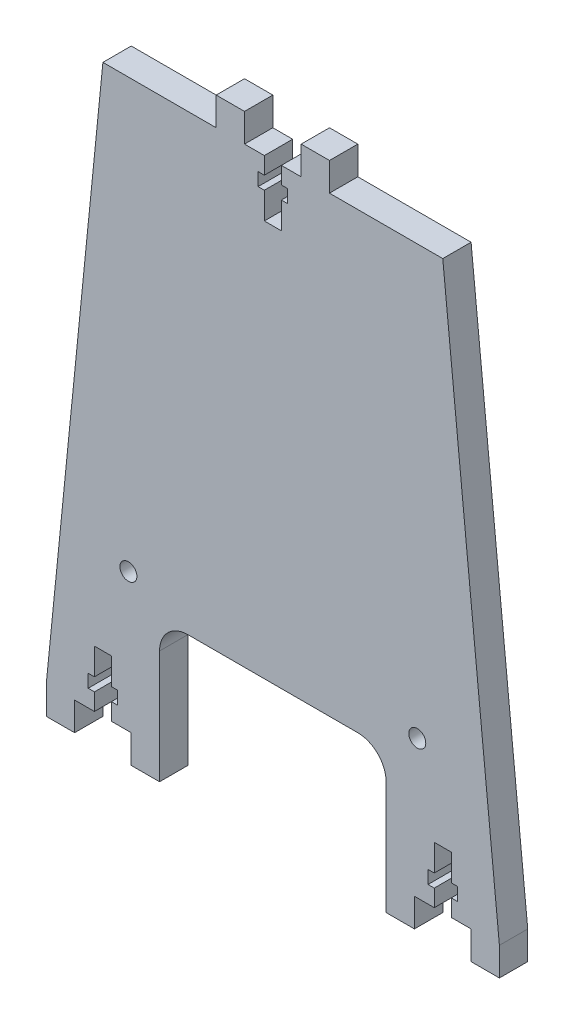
ISO-10303-21;
HEADER;
FILE_DESCRIPTION(('STEP AP214'),'2;1');
FILE_NAME('part.step','',(''),(''),'','','');
FILE_SCHEMA(('AUTOMOTIVE_DESIGN { 1 0 10303 214 1 1 1 1 }'));
ENDSEC;
DATA;
#1=APPLICATION_CONTEXT('core data for automotive mechanical design processes');
#2=APPLICATION_PROTOCOL_DEFINITION('international standard','automotive_design',2000,#1);
#3=PRODUCT_CONTEXT('',#1,'mechanical');
#4=PRODUCT('Part','Part','',(#3));
#5=PRODUCT_RELATED_PRODUCT_CATEGORY('part','',(#4));
#6=PRODUCT_DEFINITION_FORMATION('','',#4);
#7=PRODUCT_DEFINITION_CONTEXT('part definition',#1,'design');
#8=PRODUCT_DEFINITION('design','',#6,#7);
#9=PRODUCT_DEFINITION_SHAPE('','',#8);
#10=(LENGTH_UNIT() NAMED_UNIT(*) SI_UNIT(.MILLI.,.METRE.));
#11=(NAMED_UNIT(*) PLANE_ANGLE_UNIT() SI_UNIT($,.RADIAN.));
#12=(NAMED_UNIT(*) SI_UNIT($,.STERADIAN.) SOLID_ANGLE_UNIT());
#13=UNCERTAINTY_MEASURE_WITH_UNIT(LENGTH_MEASURE(1.E-05),#10,'distance_accuracy_value','');
#14=(GEOMETRIC_REPRESENTATION_CONTEXT(3) GLOBAL_UNCERTAINTY_ASSIGNED_CONTEXT((#13)) GLOBAL_UNIT_ASSIGNED_CONTEXT((#10,
#11,#12)) REPRESENTATION_CONTEXT('',''));
#15=CARTESIAN_POINT('',(0.,0.,0.));
#16=DIRECTION('',(0.,0.,1.));
#17=DIRECTION('',(1.,0.,0.));
#18=AXIS2_PLACEMENT_3D('',#15,#16,#17);
#19=CARTESIAN_POINT('',(0.,0.,5.));
#20=DIRECTION('',(0.,0.,-1.));
#21=DIRECTION('',(-1.,0.,0.));
#22=AXIS2_PLACEMENT_3D('',#19,#20,#21);
#23=PLANE('',#22);
#24=DIRECTION('',(-0.0995037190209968,0.995037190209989,0.));
#25=VECTOR('',#24,1.);
#26=CARTESIAN_POINT('',(69.9999999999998,0.,5.));
#27=LINE('',#26,#25);
#28=CARTESIAN_POINT('',(69.9999999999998,0.,5.));
#29=VERTEX_POINT('',#28);
#30=CARTESIAN_POINT('',(60.,100.,5.));
#31=VERTEX_POINT('',#30);
#32=EDGE_CURVE('E445',#29,#31,#27,.T.);
#33=ORIENTED_EDGE('',*,*,#32,.T.);
#34=DIRECTION('',(-1.,0.,0.));
#35=VECTOR('',#34,1.);
#36=CARTESIAN_POINT('',(40.,100.,5.));
#37=LINE('',#36,#35);
#38=CARTESIAN_POINT('',(40.,100.,5.));
#39=VERTEX_POINT('',#38);
#40=EDGE_CURVE('E434',#31,#39,#37,.T.);
#41=ORIENTED_EDGE('',*,*,#40,.T.);
#42=DIRECTION('',(0.,1.,0.));
#43=VECTOR('',#42,1.);
#44=CARTESIAN_POINT('',(40.,105.,5.));
#45=LINE('',#44,#43);
#46=CARTESIAN_POINT('',(40.,105.,5.));
#47=VERTEX_POINT('',#46);
#48=EDGE_CURVE('E444',#39,#47,#45,.T.);
#49=ORIENTED_EDGE('',*,*,#48,.T.);
#50=DIRECTION('',(-1.,0.,0.));
#51=VECTOR('',#50,1.);
#52=CARTESIAN_POINT('',(35.,105.,5.));
#53=LINE('',#52,#51);
#54=CARTESIAN_POINT('',(35.,105.,5.));
#55=VERTEX_POINT('',#54);
#56=EDGE_CURVE('E721',#47,#55,#53,.T.);
#57=ORIENTED_EDGE('',*,*,#56,.T.);
#58=DIRECTION('',(0.,-1.,0.));
#59=VECTOR('',#58,1.);
#60=CARTESIAN_POINT('',(35.,105.,5.));
#61=LINE('',#60,#59);
#62=CARTESIAN_POINT('',(35.,100.,5.));
#63=VERTEX_POINT('',#62);
#64=EDGE_CURVE('E858',#55,#63,#61,.T.);
#65=ORIENTED_EDGE('',*,*,#64,.T.);
#66=DIRECTION('',(-1.,0.,0.));
#67=VECTOR('',#66,1.);
#68=CARTESIAN_POINT('',(31.5,100.,5.));
#69=LINE('',#68,#67);
#70=CARTESIAN_POINT('',(31.5,100.,5.));
#71=VERTEX_POINT('',#70);
#72=EDGE_CURVE('E862',#63,#71,#69,.T.);
#73=ORIENTED_EDGE('',*,*,#72,.T.);
#74=DIRECTION('',(0.,-1.,0.));
#75=VECTOR('',#74,1.);
#76=CARTESIAN_POINT('',(31.5,97.,5.));
#77=LINE('',#76,#75);
#78=CARTESIAN_POINT('',(31.5,97.,5.));
#79=VERTEX_POINT('',#78);
#80=EDGE_CURVE('E864',#71,#79,#77,.T.);
#81=ORIENTED_EDGE('',*,*,#80,.T.);
#82=DIRECTION('',(1.,0.,0.));
#83=VECTOR('',#82,1.);
#84=CARTESIAN_POINT('',(31.5,97.,5.));
#85=LINE('',#84,#83);
#86=CARTESIAN_POINT('',(32.6000000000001,97.,5.));
#87=VERTEX_POINT('',#86);
#88=EDGE_CURVE('E866',#79,#87,#85,.T.);
#89=ORIENTED_EDGE('',*,*,#88,.T.);
#90=DIRECTION('',(0.,-1.,0.));
#91=VECTOR('',#90,1.);
#92=CARTESIAN_POINT('',(32.6000000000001,97.,5.));
#93=LINE('',#92,#91);
#94=CARTESIAN_POINT('',(32.6000000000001,94.7,5.));
#95=VERTEX_POINT('',#94);
#96=EDGE_CURVE('E868',#87,#95,#93,.T.);
#97=ORIENTED_EDGE('',*,*,#96,.T.);
#98=DIRECTION('',(-1.,0.,0.));
#99=VECTOR('',#98,1.);
#100=CARTESIAN_POINT('',(32.6000000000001,94.7,5.));
#101=LINE('',#100,#99);
#102=CARTESIAN_POINT('',(31.5,94.7,5.));
#103=VERTEX_POINT('',#102);
#104=EDGE_CURVE('E870',#95,#103,#101,.T.);
#105=ORIENTED_EDGE('',*,*,#104,.T.);
#106=DIRECTION('',(0.,-1.,0.));
#107=VECTOR('',#106,1.);
#108=CARTESIAN_POINT('',(31.5,90.,5.));
#109=LINE('',#108,#107);
#110=CARTESIAN_POINT('',(31.5,90.,5.));
#111=VERTEX_POINT('',#110);
#112=EDGE_CURVE('E872',#103,#111,#109,.T.);
#113=ORIENTED_EDGE('',*,*,#112,.T.);
#114=DIRECTION('',(-1.,0.,0.));
#115=VECTOR('',#114,1.);
#116=CARTESIAN_POINT('',(28.5,90.,5.));
#117=LINE('',#116,#115);
#118=CARTESIAN_POINT('',(28.5,90.,5.));
#119=VERTEX_POINT('',#118);
#120=EDGE_CURVE('E874',#111,#119,#117,.T.);
#121=ORIENTED_EDGE('',*,*,#120,.T.);
#122=DIRECTION('',(0.,1.,0.));
#123=VECTOR('',#122,1.);
#124=CARTESIAN_POINT('',(28.5,94.7,5.));
#125=LINE('',#124,#123);
#126=CARTESIAN_POINT('',(28.5,94.7,5.));
#127=VERTEX_POINT('',#126);
#128=EDGE_CURVE('E876',#119,#127,#125,.T.);
#129=ORIENTED_EDGE('',*,*,#128,.T.);
#130=DIRECTION('',(-1.,0.,0.));
#131=VECTOR('',#130,1.);
#132=CARTESIAN_POINT('',(28.5,94.7,5.));
#133=LINE('',#132,#131);
#134=CARTESIAN_POINT('',(27.3999999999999,94.7,5.));
#135=VERTEX_POINT('',#134);
#136=EDGE_CURVE('E878',#127,#135,#133,.T.);
#137=ORIENTED_EDGE('',*,*,#136,.T.);
#138=DIRECTION('',(0.,1.,0.));
#139=VECTOR('',#138,1.);
#140=CARTESIAN_POINT('',(27.3999999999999,94.7,5.));
#141=LINE('',#140,#139);
#142=CARTESIAN_POINT('',(27.3999999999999,97.,5.));
#143=VERTEX_POINT('',#142);
#144=EDGE_CURVE('E880',#135,#143,#141,.T.);
#145=ORIENTED_EDGE('',*,*,#144,.T.);
#146=DIRECTION('',(1.,0.,0.));
#147=VECTOR('',#146,1.);
#148=CARTESIAN_POINT('',(27.3999999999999,97.,5.));
#149=LINE('',#148,#147);
#150=CARTESIAN_POINT('',(28.5,97.,5.));
#151=VERTEX_POINT('',#150);
#152=EDGE_CURVE('E882',#143,#151,#149,.T.);
#153=ORIENTED_EDGE('',*,*,#152,.T.);
#154=DIRECTION('',(0.,1.,0.));
#155=VECTOR('',#154,1.);
#156=CARTESIAN_POINT('',(28.5,100.,5.));
#157=LINE('',#156,#155);
#158=CARTESIAN_POINT('',(28.5,100.,5.));
#159=VERTEX_POINT('',#158);
#160=EDGE_CURVE('E884',#151,#159,#157,.T.);
#161=ORIENTED_EDGE('',*,*,#160,.T.);
#162=DIRECTION('',(-1.,0.,0.));
#163=VECTOR('',#162,1.);
#164=CARTESIAN_POINT('',(28.5,100.,5.));
#165=LINE('',#164,#163);
#166=CARTESIAN_POINT('',(25.,100.,5.));
#167=VERTEX_POINT('',#166);
#168=EDGE_CURVE('E886',#159,#167,#165,.T.);
#169=ORIENTED_EDGE('',*,*,#168,.T.);
#170=DIRECTION('',(0.,1.,0.));
#171=VECTOR('',#170,1.);
#172=CARTESIAN_POINT('',(25.,100.,5.));
#173=LINE('',#172,#171);
#174=CARTESIAN_POINT('',(25.,105.,5.));
#175=VERTEX_POINT('',#174);
#176=EDGE_CURVE('E888',#167,#175,#173,.T.);
#177=ORIENTED_EDGE('',*,*,#176,.T.);
#178=DIRECTION('',(-1.,0.,0.));
#179=VECTOR('',#178,1.);
#180=CARTESIAN_POINT('',(25.,105.,5.));
#181=LINE('',#180,#179);
#182=CARTESIAN_POINT('',(20.,105.,5.));
#183=VERTEX_POINT('',#182);
#184=EDGE_CURVE('E890',#175,#183,#181,.T.);
#185=ORIENTED_EDGE('',*,*,#184,.T.);
#186=DIRECTION('',(0.,-1.,0.));
#187=VECTOR('',#186,1.);
#188=CARTESIAN_POINT('',(20.,105.,5.));
#189=LINE('',#188,#187);
#190=CARTESIAN_POINT('',(20.,100.,5.));
#191=VERTEX_POINT('',#190);
#192=EDGE_CURVE('E892',#183,#191,#189,.T.);
#193=ORIENTED_EDGE('',*,*,#192,.T.);
#194=DIRECTION('',(-1.,0.,0.));
#195=VECTOR('',#194,1.);
#196=CARTESIAN_POINT('',(0.,100.,5.));
#197=LINE('',#196,#195);
#198=CARTESIAN_POINT('',(0.,100.,5.));
#199=VERTEX_POINT('',#198);
#200=EDGE_CURVE('E894',#191,#199,#197,.T.);
#201=ORIENTED_EDGE('',*,*,#200,.T.);
#202=DIRECTION('',(-0.0995037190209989,-0.995037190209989,0.));
#203=VECTOR('',#202,1.);
#204=CARTESIAN_POINT('',(-10.,0.,5.));
#205=LINE('',#204,#203);
#206=CARTESIAN_POINT('',(-10.,0.,5.));
#207=VERTEX_POINT('',#206);
#208=EDGE_CURVE('E896',#199,#207,#205,.T.);
#209=ORIENTED_EDGE('',*,*,#208,.T.);
#210=DIRECTION('',(0.,-1.,0.));
#211=VECTOR('',#210,1.);
#212=CARTESIAN_POINT('',(-10.,-5.,5.));
#213=LINE('',#212,#211);
#214=CARTESIAN_POINT('',(-10.,-5.,5.));
#215=VERTEX_POINT('',#214);
#216=EDGE_CURVE('E898',#207,#215,#213,.T.);
#217=ORIENTED_EDGE('',*,*,#216,.T.);
#218=DIRECTION('',(1.,0.,0.));
#219=VECTOR('',#218,1.);
#220=CARTESIAN_POINT('',(-5.,-5.,5.));
#221=LINE('',#220,#219);
#222=CARTESIAN_POINT('',(-5.,-5.,5.));
#223=VERTEX_POINT('',#222);
#224=EDGE_CURVE('E900',#215,#223,#221,.T.);
#225=ORIENTED_EDGE('',*,*,#224,.T.);
#226=DIRECTION('',(0.,1.,0.));
#227=VECTOR('',#226,1.);
#228=CARTESIAN_POINT('',(-5.,-5.,5.));
#229=LINE('',#228,#227);
#230=CARTESIAN_POINT('',(-5.,0.,5.));
#231=VERTEX_POINT('',#230);
#232=EDGE_CURVE('E902',#223,#231,#229,.T.);
#233=ORIENTED_EDGE('',*,*,#232,.T.);
#234=DIRECTION('',(1.,0.,0.));
#235=VECTOR('',#234,1.);
#236=CARTESIAN_POINT('',(-1.5,0.,5.));
#237=LINE('',#236,#235);
#238=CARTESIAN_POINT('',(-1.5,0.,5.));
#239=VERTEX_POINT('',#238);
#240=EDGE_CURVE('E904',#231,#239,#237,.T.);
#241=ORIENTED_EDGE('',*,*,#240,.T.);
#242=DIRECTION('',(0.,1.,0.));
#243=VECTOR('',#242,1.);
#244=CARTESIAN_POINT('',(-1.5,3.00000000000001,5.));
#245=LINE('',#244,#243);
#246=CARTESIAN_POINT('',(-1.5,3.00000000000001,5.));
#247=VERTEX_POINT('',#246);
#248=EDGE_CURVE('E906',#239,#247,#245,.T.);
#249=ORIENTED_EDGE('',*,*,#248,.T.);
#250=DIRECTION('',(-1.,0.,0.));
#251=VECTOR('',#250,1.);
#252=CARTESIAN_POINT('',(-1.5,3.00000000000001,5.));
#253=LINE('',#252,#251);
#254=CARTESIAN_POINT('',(-2.6,3.00000000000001,5.));
#255=VERTEX_POINT('',#254);
#256=EDGE_CURVE('E908',#247,#255,#253,.T.);
#257=ORIENTED_EDGE('',*,*,#256,.T.);
#258=DIRECTION('',(0.,1.,0.));
#259=VECTOR('',#258,1.);
#260=CARTESIAN_POINT('',(-2.6,3.00000000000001,5.));
#261=LINE('',#260,#259);
#262=CARTESIAN_POINT('',(-2.6,5.3,5.));
#263=VERTEX_POINT('',#262);
#264=EDGE_CURVE('E910',#255,#263,#261,.T.);
#265=ORIENTED_EDGE('',*,*,#264,.T.);
#266=DIRECTION('',(1.,0.,0.));
#267=VECTOR('',#266,1.);
#268=CARTESIAN_POINT('',(-2.6,5.3,5.));
#269=LINE('',#268,#267);
#270=CARTESIAN_POINT('',(-1.5,5.3,5.));
#271=VERTEX_POINT('',#270);
#272=EDGE_CURVE('E912',#263,#271,#269,.T.);
#273=ORIENTED_EDGE('',*,*,#272,.T.);
#274=DIRECTION('',(0.,1.,0.));
#275=VECTOR('',#274,1.);
#276=CARTESIAN_POINT('',(-1.5,10.,5.));
#277=LINE('',#276,#275);
#278=CARTESIAN_POINT('',(-1.5,10.,5.));
#279=VERTEX_POINT('',#278);
#280=EDGE_CURVE('E914',#271,#279,#277,.T.);
#281=ORIENTED_EDGE('',*,*,#280,.T.);
#282=DIRECTION('',(1.,0.,0.));
#283=VECTOR('',#282,1.);
#284=CARTESIAN_POINT('',(1.5,10.,5.));
#285=LINE('',#284,#283);
#286=CARTESIAN_POINT('',(1.5,10.,5.));
#287=VERTEX_POINT('',#286);
#288=EDGE_CURVE('E916',#279,#287,#285,.T.);
#289=ORIENTED_EDGE('',*,*,#288,.T.);
#290=DIRECTION('',(0.,-1.,0.));
#291=VECTOR('',#290,1.);
#292=CARTESIAN_POINT('',(1.5,5.3,5.));
#293=LINE('',#292,#291);
#294=CARTESIAN_POINT('',(1.5,5.3,5.));
#295=VERTEX_POINT('',#294);
#296=EDGE_CURVE('E918',#287,#295,#293,.T.);
#297=ORIENTED_EDGE('',*,*,#296,.T.);
#298=DIRECTION('',(1.,0.,0.));
#299=VECTOR('',#298,1.);
#300=CARTESIAN_POINT('',(1.5,5.3,5.));
#301=LINE('',#300,#299);
#302=CARTESIAN_POINT('',(2.6,5.3,5.));
#303=VERTEX_POINT('',#302);
#304=EDGE_CURVE('E920',#295,#303,#301,.T.);
#305=ORIENTED_EDGE('',*,*,#304,.T.);
#306=DIRECTION('',(0.,-1.,0.));
#307=VECTOR('',#306,1.);
#308=CARTESIAN_POINT('',(2.6,5.3,5.));
#309=LINE('',#308,#307);
#310=CARTESIAN_POINT('',(2.6,3.00000000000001,5.));
#311=VERTEX_POINT('',#310);
#312=EDGE_CURVE('E922',#303,#311,#309,.T.);
#313=ORIENTED_EDGE('',*,*,#312,.T.);
#314=DIRECTION('',(-1.,0.,0.));
#315=VECTOR('',#314,1.);
#316=CARTESIAN_POINT('',(2.6,3.00000000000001,5.));
#317=LINE('',#316,#315);
#318=CARTESIAN_POINT('',(1.5,3.00000000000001,5.));
#319=VERTEX_POINT('',#318);
#320=EDGE_CURVE('E924',#311,#319,#317,.T.);
#321=ORIENTED_EDGE('',*,*,#320,.T.);
#322=DIRECTION('',(0.,-1.,0.));
#323=VECTOR('',#322,1.);
#324=CARTESIAN_POINT('',(1.5,0.,5.));
#325=LINE('',#324,#323);
#326=CARTESIAN_POINT('',(1.5,0.,5.));
#327=VERTEX_POINT('',#326);
#328=EDGE_CURVE('E926',#319,#327,#325,.T.);
#329=ORIENTED_EDGE('',*,*,#328,.T.);
#330=DIRECTION('',(1.,0.,0.));
#331=VECTOR('',#330,1.);
#332=CARTESIAN_POINT('',(1.5,0.,5.));
#333=LINE('',#332,#331);
#334=CARTESIAN_POINT('',(5.,0.,5.));
#335=VERTEX_POINT('',#334);
#336=EDGE_CURVE('E928',#327,#335,#333,.T.);
#337=ORIENTED_EDGE('',*,*,#336,.T.);
#338=DIRECTION('',(0.,-1.,0.));
#339=VECTOR('',#338,1.);
#340=CARTESIAN_POINT('',(5.,0.,5.));
#341=LINE('',#340,#339);
#342=CARTESIAN_POINT('',(5.,-5.,5.));
#343=VERTEX_POINT('',#342);
#344=EDGE_CURVE('E817',#335,#343,#341,.T.);
#345=ORIENTED_EDGE('',*,*,#344,.T.);
#346=DIRECTION('',(1.,0.,0.));
#347=VECTOR('',#346,1.);
#348=CARTESIAN_POINT('',(5.,-5.,5.));
#349=LINE('',#348,#347);
#350=CARTESIAN_POINT('',(10.,-5.,5.));
#351=VERTEX_POINT('',#350);
#352=EDGE_CURVE('E814',#343,#351,#349,.T.);
#353=ORIENTED_EDGE('',*,*,#352,.T.);
#354=DIRECTION('',(0.,1.,0.));
#355=VECTOR('',#354,1.);
#356=CARTESIAN_POINT('',(10.,-5.,5.));
#357=LINE('',#356,#355);
#358=CARTESIAN_POINT('',(10.,14.9999999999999,5.));
#359=VERTEX_POINT('',#358);
#360=EDGE_CURVE('E812',#351,#359,#357,.T.);
#361=ORIENTED_EDGE('',*,*,#360,.T.);
#362=CARTESIAN_POINT('',(14.9999999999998,15.,5.));
#363=DIRECTION('',(0.,0.,-1.));
#364=DIRECTION('',(-1.,0.,0.));
#365=AXIS2_PLACEMENT_3D('',#362,#363,#364);
#366=CIRCLE('',#365,5.);
#367=CARTESIAN_POINT('',(14.9999999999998,20.,5.));
#368=VERTEX_POINT('',#367);
#369=EDGE_CURVE('E11',#359,#368,#366,.T.);
#370=ORIENTED_EDGE('',*,*,#369,.T.);
#371=DIRECTION('',(1.,0.,0.));
#372=VECTOR('',#371,1.);
#373=CARTESIAN_POINT('',(9.99999999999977,20.,5.));
#374=LINE('',#373,#372);
#375=CARTESIAN_POINT('',(44.9999999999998,20.,5.));
#376=VERTEX_POINT('',#375);
#377=EDGE_CURVE('E482',#368,#376,#374,.T.);
#378=ORIENTED_EDGE('',*,*,#377,.T.);
#379=CARTESIAN_POINT('',(44.9999999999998,15.,5.));
#380=DIRECTION('',(0.,0.,-1.));
#381=DIRECTION('',(-1.,0.,0.));
#382=AXIS2_PLACEMENT_3D('',#379,#380,#381);
#383=CIRCLE('',#382,5.);
#384=CARTESIAN_POINT('',(49.9999999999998,15.,5.));
#385=VERTEX_POINT('',#384);
#386=EDGE_CURVE('E475',#376,#385,#383,.T.);
#387=ORIENTED_EDGE('',*,*,#386,.T.);
#388=DIRECTION('',(0.,-1.,0.));
#389=VECTOR('',#388,1.);
#390=CARTESIAN_POINT('',(49.9999999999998,20.,5.));
#391=LINE('',#390,#389);
#392=CARTESIAN_POINT('',(49.9999999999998,-5.00000000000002,5.));
#393=VERTEX_POINT('',#392);
#394=EDGE_CURVE('E479',#385,#393,#391,.T.);
#395=ORIENTED_EDGE('',*,*,#394,.T.);
#396=DIRECTION('',(1.,0.,0.));
#397=VECTOR('',#396,1.);
#398=CARTESIAN_POINT('',(54.9999999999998,-5.00000000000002,5.));
#399=LINE('',#398,#397);
#400=CARTESIAN_POINT('',(54.9999999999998,-5.00000000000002,5.));
#401=VERTEX_POINT('',#400);
#402=EDGE_CURVE('E492',#393,#401,#399,.T.);
#403=ORIENTED_EDGE('',*,*,#402,.T.);
#404=DIRECTION('',(0.,1.,0.));
#405=VECTOR('',#404,1.);
#406=CARTESIAN_POINT('',(54.9999999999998,-5.00000000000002,5.));
#407=LINE('',#406,#405);
#408=CARTESIAN_POINT('',(54.9999999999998,0.,5.));
#409=VERTEX_POINT('',#408);
#410=EDGE_CURVE('E822',#401,#409,#407,.T.);
#411=ORIENTED_EDGE('',*,*,#410,.T.);
#412=DIRECTION('',(1.,0.,0.));
#413=VECTOR('',#412,1.);
#414=CARTESIAN_POINT('',(58.4999999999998,0.,5.));
#415=LINE('',#414,#413);
#416=CARTESIAN_POINT('',(58.4999999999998,0.,5.));
#417=VERTEX_POINT('',#416);
#418=EDGE_CURVE('E824',#409,#417,#415,.T.);
#419=ORIENTED_EDGE('',*,*,#418,.T.);
#420=DIRECTION('',(0.,1.,0.));
#421=VECTOR('',#420,1.);
#422=CARTESIAN_POINT('',(58.4999999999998,2.99999999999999,5.));
#423=LINE('',#422,#421);
#424=CARTESIAN_POINT('',(58.4999999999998,2.99999999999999,5.));
#425=VERTEX_POINT('',#424);
#426=EDGE_CURVE('E826',#417,#425,#423,.T.);
#427=ORIENTED_EDGE('',*,*,#426,.T.);
#428=DIRECTION('',(-1.,0.,0.));
#429=VECTOR('',#428,1.);
#430=CARTESIAN_POINT('',(58.4999999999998,2.99999999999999,5.));
#431=LINE('',#430,#429);
#432=CARTESIAN_POINT('',(57.3999999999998,2.99999999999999,5.));
#433=VERTEX_POINT('',#432);
#434=EDGE_CURVE('E828',#425,#433,#431,.T.);
#435=ORIENTED_EDGE('',*,*,#434,.T.);
#436=DIRECTION('',(0.,1.,0.));
#437=VECTOR('',#436,1.);
#438=CARTESIAN_POINT('',(57.3999999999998,2.99999999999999,5.));
#439=LINE('',#438,#437);
#440=CARTESIAN_POINT('',(57.3999999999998,5.29999999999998,5.));
#441=VERTEX_POINT('',#440);
#442=EDGE_CURVE('E830',#433,#441,#439,.T.);
#443=ORIENTED_EDGE('',*,*,#442,.T.);
#444=DIRECTION('',(1.,0.,0.));
#445=VECTOR('',#444,1.);
#446=CARTESIAN_POINT('',(57.3999999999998,5.29999999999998,5.));
#447=LINE('',#446,#445);
#448=CARTESIAN_POINT('',(58.4999999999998,5.29999999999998,5.));
#449=VERTEX_POINT('',#448);
#450=EDGE_CURVE('E832',#441,#449,#447,.T.);
#451=ORIENTED_EDGE('',*,*,#450,.T.);
#452=DIRECTION('',(0.,1.,0.));
#453=VECTOR('',#452,1.);
#454=CARTESIAN_POINT('',(58.4999999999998,9.99999999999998,5.));
#455=LINE('',#454,#453);
#456=CARTESIAN_POINT('',(58.4999999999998,9.99999999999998,5.));
#457=VERTEX_POINT('',#456);
#458=EDGE_CURVE('E834',#449,#457,#455,.T.);
#459=ORIENTED_EDGE('',*,*,#458,.T.);
#460=DIRECTION('',(1.,0.,0.));
#461=VECTOR('',#460,1.);
#462=CARTESIAN_POINT('',(61.4999999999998,9.99999999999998,5.));
#463=LINE('',#462,#461);
#464=CARTESIAN_POINT('',(61.4999999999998,9.99999999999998,5.));
#465=VERTEX_POINT('',#464);
#466=EDGE_CURVE('E836',#457,#465,#463,.T.);
#467=ORIENTED_EDGE('',*,*,#466,.T.);
#468=DIRECTION('',(0.,-1.,0.));
#469=VECTOR('',#468,1.);
#470=CARTESIAN_POINT('',(61.4999999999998,5.29999999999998,5.));
#471=LINE('',#470,#469);
#472=CARTESIAN_POINT('',(61.4999999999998,5.29999999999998,5.));
#473=VERTEX_POINT('',#472);
#474=EDGE_CURVE('E838',#465,#473,#471,.T.);
#475=ORIENTED_EDGE('',*,*,#474,.T.);
#476=DIRECTION('',(1.,0.,0.));
#477=VECTOR('',#476,1.);
#478=CARTESIAN_POINT('',(61.4999999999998,5.29999999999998,5.));
#479=LINE('',#478,#477);
#480=CARTESIAN_POINT('',(62.5999999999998,5.29999999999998,5.));
#481=VERTEX_POINT('',#480);
#482=EDGE_CURVE('E840',#473,#481,#479,.T.);
#483=ORIENTED_EDGE('',*,*,#482,.T.);
#484=DIRECTION('',(0.,-1.,0.));
#485=VECTOR('',#484,1.);
#486=CARTESIAN_POINT('',(62.5999999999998,5.29999999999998,5.));
#487=LINE('',#486,#485);
#488=CARTESIAN_POINT('',(62.5999999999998,2.99999999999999,5.));
#489=VERTEX_POINT('',#488);
#490=EDGE_CURVE('E842',#481,#489,#487,.T.);
#491=ORIENTED_EDGE('',*,*,#490,.T.);
#492=DIRECTION('',(-1.,0.,0.));
#493=VECTOR('',#492,1.);
#494=CARTESIAN_POINT('',(62.5999999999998,2.99999999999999,5.));
#495=LINE('',#494,#493);
#496=CARTESIAN_POINT('',(61.4999999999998,2.99999999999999,5.));
#497=VERTEX_POINT('',#496);
#498=EDGE_CURVE('E844',#489,#497,#495,.T.);
#499=ORIENTED_EDGE('',*,*,#498,.T.);
#500=DIRECTION('',(0.,-1.,0.));
#501=VECTOR('',#500,1.);
#502=CARTESIAN_POINT('',(61.4999999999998,0.,5.));
#503=LINE('',#502,#501);
#504=CARTESIAN_POINT('',(61.4999999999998,0.,5.));
#505=VERTEX_POINT('',#504);
#506=EDGE_CURVE('E846',#497,#505,#503,.T.);
#507=ORIENTED_EDGE('',*,*,#506,.T.);
#508=DIRECTION('',(1.,0.,0.));
#509=VECTOR('',#508,1.);
#510=CARTESIAN_POINT('',(61.4999999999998,0.,5.));
#511=LINE('',#510,#509);
#512=CARTESIAN_POINT('',(64.9999999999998,0.,5.));
#513=VERTEX_POINT('',#512);
#514=EDGE_CURVE('E848',#505,#513,#511,.T.);
#515=ORIENTED_EDGE('',*,*,#514,.T.);
#516=DIRECTION('',(0.,-1.,0.));
#517=VECTOR('',#516,1.);
#518=CARTESIAN_POINT('',(64.9999999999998,0.,5.));
#519=LINE('',#518,#517);
#520=CARTESIAN_POINT('',(64.9999999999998,-5.00000000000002,5.));
#521=VERTEX_POINT('',#520);
#522=EDGE_CURVE('E850',#513,#521,#519,.T.);
#523=ORIENTED_EDGE('',*,*,#522,.T.);
#524=DIRECTION('',(1.,0.,0.));
#525=VECTOR('',#524,1.);
#526=CARTESIAN_POINT('',(64.9999999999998,-5.00000000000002,5.));
#527=LINE('',#526,#525);
#528=CARTESIAN_POINT('',(69.9999999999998,-5.00000000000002,5.));
#529=VERTEX_POINT('',#528);
#530=EDGE_CURVE('E852',#521,#529,#527,.T.);
#531=ORIENTED_EDGE('',*,*,#530,.T.);
#532=DIRECTION('',(0.,1.,0.));
#533=VECTOR('',#532,1.);
#534=CARTESIAN_POINT('',(69.9999999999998,-5.00000000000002,5.));
#535=LINE('',#534,#533);
#536=EDGE_CURVE('E450',#529,#29,#535,.T.);
#537=ORIENTED_EDGE('',*,*,#536,.T.);
#538=EDGE_LOOP('',(#33,#41,#49,#57,#65,#73,#81,#89,#97,#105,#113,#121,#129,#137,#145,#153,#161,
#169,#177,#185,#193,#201,#209,#217,#225,#233,#241,#249,#257,#265,#273,#281,#289,#297,#305,#313,
#321,#329,#337,#345,#353,#361,#370,#378,#387,#395,#403,#411,#419,#427,#435,#443,#451,#459,#467,
#475,#483,#491,#499,#507,#515,#523,#531,#537));
#539=FACE_BOUND('',#538,.T.);
#540=CARTESIAN_POINT('',(55.5,24.4,5.));
#541=DIRECTION('',(0.,0.,1.));
#542=DIRECTION('',(1.,0.,0.));
#543=AXIS2_PLACEMENT_3D('',#540,#541,#542);
#544=CIRCLE('',#543,1.5);
#545=CARTESIAN_POINT('',(57.,24.4,5.));
#546=VERTEX_POINT('',#545);
#547=EDGE_CURVE('E855',#546,#546,#544,.T.);
#548=ORIENTED_EDGE('',*,*,#547,.F.);
#549=EDGE_LOOP('',(#548));
#550=FACE_BOUND('',#549,.T.);
#551=CARTESIAN_POINT('',(4.5,24.4,5.));
#552=DIRECTION('',(0.,0.,1.));
#553=DIRECTION('',(-1.,0.,0.));
#554=AXIS2_PLACEMENT_3D('',#551,#552,#553);
#555=CIRCLE('',#554,1.5);
#556=CARTESIAN_POINT('',(2.99999999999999,24.4,5.));
#557=VERTEX_POINT('',#556);
#558=EDGE_CURVE('E1698',#557,#557,#555,.T.);
#559=ORIENTED_EDGE('',*,*,#558,.F.);
#560=EDGE_LOOP('',(#559));
#561=FACE_BOUND('',#560,.T.);
#562=ADVANCED_FACE('F34',(#539,#550,#561),#23,.F.);
#563=CARTESIAN_POINT('',(0.,0.,0.));
#564=DIRECTION('',(0.,0.,-1.));
#565=DIRECTION('',(-1.,0.,0.));
#566=AXIS2_PLACEMENT_3D('',#563,#564,#565);
#567=PLANE('',#566);
#568=CARTESIAN_POINT('',(55.5,24.4,0.));
#569=DIRECTION('',(0.,0.,1.));
#570=DIRECTION('',(1.,0.,0.));
#571=AXIS2_PLACEMENT_3D('',#568,#569,#570);
#572=CIRCLE('',#571,1.5);
#573=CARTESIAN_POINT('',(57.,24.4,0.));
#574=VERTEX_POINT('',#573);
#575=EDGE_CURVE('E1703',#574,#574,#572,.T.);
#576=ORIENTED_EDGE('',*,*,#575,.T.);
#577=EDGE_LOOP('',(#576));
#578=FACE_BOUND('',#577,.T.);
#579=DIRECTION('',(-0.0995037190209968,0.995037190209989,0.));
#580=VECTOR('',#579,1.);
#581=CARTESIAN_POINT('',(69.9999999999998,0.,0.));
#582=LINE('',#581,#580);
#583=CARTESIAN_POINT('',(69.9999999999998,0.,0.));
#584=VERTEX_POINT('',#583);
#585=CARTESIAN_POINT('',(60.,100.,0.));
#586=VERTEX_POINT('',#585);
#587=EDGE_CURVE('E458',#584,#586,#582,.T.);
#588=ORIENTED_EDGE('',*,*,#587,.F.);
#589=DIRECTION('',(0.,1.,0.));
#590=VECTOR('',#589,1.);
#591=CARTESIAN_POINT('',(69.9999999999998,-5.00000000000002,0.));
#592=LINE('',#591,#590);
#593=CARTESIAN_POINT('',(69.9999999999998,-5.00000000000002,0.));
#594=VERTEX_POINT('',#593);
#595=EDGE_CURVE('E454',#594,#584,#592,.T.);
#596=ORIENTED_EDGE('',*,*,#595,.F.);
#597=DIRECTION('',(1.,0.,0.));
#598=VECTOR('',#597,1.);
#599=CARTESIAN_POINT('',(64.9999999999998,-5.00000000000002,0.));
#600=LINE('',#599,#598);
#601=CARTESIAN_POINT('',(64.9999999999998,-5.00000000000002,0.));
#602=VERTEX_POINT('',#601);
#603=EDGE_CURVE('E543',#602,#594,#600,.T.);
#604=ORIENTED_EDGE('',*,*,#603,.F.);
#605=DIRECTION('',(0.,-1.,0.));
#606=VECTOR('',#605,1.);
#607=CARTESIAN_POINT('',(64.9999999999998,0.,0.));
#608=LINE('',#607,#606);
#609=CARTESIAN_POINT('',(64.9999999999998,0.,0.));
#610=VERTEX_POINT('',#609);
#611=EDGE_CURVE('E541',#610,#602,#608,.T.);
#612=ORIENTED_EDGE('',*,*,#611,.F.);
#613=DIRECTION('',(1.,0.,0.));
#614=VECTOR('',#613,1.);
#615=CARTESIAN_POINT('',(61.4999999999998,0.,0.));
#616=LINE('',#615,#614);
#617=CARTESIAN_POINT('',(61.4999999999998,0.,0.));
#618=VERTEX_POINT('',#617);
#619=EDGE_CURVE('E539',#618,#610,#616,.T.);
#620=ORIENTED_EDGE('',*,*,#619,.F.);
#621=DIRECTION('',(0.,-1.,0.));
#622=VECTOR('',#621,1.);
#623=CARTESIAN_POINT('',(61.4999999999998,0.,0.));
#624=LINE('',#623,#622);
#625=CARTESIAN_POINT('',(61.4999999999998,2.99999999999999,0.));
#626=VERTEX_POINT('',#625);
#627=EDGE_CURVE('E537',#626,#618,#624,.T.);
#628=ORIENTED_EDGE('',*,*,#627,.F.);
#629=DIRECTION('',(-1.,0.,0.));
#630=VECTOR('',#629,1.);
#631=CARTESIAN_POINT('',(62.5999999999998,2.99999999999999,0.));
#632=LINE('',#631,#630);
#633=CARTESIAN_POINT('',(62.5999999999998,2.99999999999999,0.));
#634=VERTEX_POINT('',#633);
#635=EDGE_CURVE('E535',#634,#626,#632,.T.);
#636=ORIENTED_EDGE('',*,*,#635,.F.);
#637=DIRECTION('',(0.,-1.,0.));
#638=VECTOR('',#637,1.);
#639=CARTESIAN_POINT('',(62.5999999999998,5.29999999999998,0.));
#640=LINE('',#639,#638);
#641=CARTESIAN_POINT('',(62.5999999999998,5.29999999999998,0.));
#642=VERTEX_POINT('',#641);
#643=EDGE_CURVE('E533',#642,#634,#640,.T.);
#644=ORIENTED_EDGE('',*,*,#643,.F.);
#645=DIRECTION('',(1.,0.,0.));
#646=VECTOR('',#645,1.);
#647=CARTESIAN_POINT('',(61.4999999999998,5.29999999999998,0.));
#648=LINE('',#647,#646);
#649=CARTESIAN_POINT('',(61.4999999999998,5.29999999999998,0.));
#650=VERTEX_POINT('',#649);
#651=EDGE_CURVE('E531',#650,#642,#648,.T.);
#652=ORIENTED_EDGE('',*,*,#651,.F.);
#653=DIRECTION('',(0.,-1.,0.));
#654=VECTOR('',#653,1.);
#655=CARTESIAN_POINT('',(61.4999999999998,5.29999999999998,0.));
#656=LINE('',#655,#654);
#657=CARTESIAN_POINT('',(61.4999999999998,9.99999999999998,0.));
#658=VERTEX_POINT('',#657);
#659=EDGE_CURVE('E529',#658,#650,#656,.T.);
#660=ORIENTED_EDGE('',*,*,#659,.F.);
#661=DIRECTION('',(1.,0.,0.));
#662=VECTOR('',#661,1.);
#663=CARTESIAN_POINT('',(61.4999999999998,9.99999999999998,0.));
#664=LINE('',#663,#662);
#665=CARTESIAN_POINT('',(58.4999999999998,9.99999999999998,0.));
#666=VERTEX_POINT('',#665);
#667=EDGE_CURVE('E527',#666,#658,#664,.T.);
#668=ORIENTED_EDGE('',*,*,#667,.F.);
#669=DIRECTION('',(0.,1.,0.));
#670=VECTOR('',#669,1.);
#671=CARTESIAN_POINT('',(58.4999999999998,9.99999999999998,0.));
#672=LINE('',#671,#670);
#673=CARTESIAN_POINT('',(58.4999999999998,5.29999999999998,0.));
#674=VERTEX_POINT('',#673);
#675=EDGE_CURVE('E525',#674,#666,#672,.T.);
#676=ORIENTED_EDGE('',*,*,#675,.F.);
#677=DIRECTION('',(1.,0.,0.));
#678=VECTOR('',#677,1.);
#679=CARTESIAN_POINT('',(57.3999999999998,5.29999999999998,0.));
#680=LINE('',#679,#678);
#681=CARTESIAN_POINT('',(57.3999999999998,5.29999999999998,0.));
#682=VERTEX_POINT('',#681);
#683=EDGE_CURVE('E523',#682,#674,#680,.T.);
#684=ORIENTED_EDGE('',*,*,#683,.F.);
#685=DIRECTION('',(0.,1.,0.));
#686=VECTOR('',#685,1.);
#687=CARTESIAN_POINT('',(57.3999999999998,2.99999999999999,0.));
#688=LINE('',#687,#686);
#689=CARTESIAN_POINT('',(57.3999999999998,2.99999999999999,0.));
#690=VERTEX_POINT('',#689);
#691=EDGE_CURVE('E521',#690,#682,#688,.T.);
#692=ORIENTED_EDGE('',*,*,#691,.F.);
#693=DIRECTION('',(-1.,0.,0.));
#694=VECTOR('',#693,1.);
#695=CARTESIAN_POINT('',(58.4999999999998,2.99999999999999,0.));
#696=LINE('',#695,#694);
#697=CARTESIAN_POINT('',(58.4999999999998,2.99999999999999,0.));
#698=VERTEX_POINT('',#697);
#699=EDGE_CURVE('E519',#698,#690,#696,.T.);
#700=ORIENTED_EDGE('',*,*,#699,.F.);
#701=DIRECTION('',(0.,1.,0.));
#702=VECTOR('',#701,1.);
#703=CARTESIAN_POINT('',(58.4999999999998,2.99999999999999,0.));
#704=LINE('',#703,#702);
#705=CARTESIAN_POINT('',(58.4999999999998,0.,0.));
#706=VERTEX_POINT('',#705);
#707=EDGE_CURVE('E517',#706,#698,#704,.T.);
#708=ORIENTED_EDGE('',*,*,#707,.F.);
#709=DIRECTION('',(1.,0.,0.));
#710=VECTOR('',#709,1.);
#711=CARTESIAN_POINT('',(58.4999999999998,0.,0.));
#712=LINE('',#711,#710);
#713=CARTESIAN_POINT('',(54.9999999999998,0.,0.));
#714=VERTEX_POINT('',#713);
#715=EDGE_CURVE('E515',#714,#706,#712,.T.);
#716=ORIENTED_EDGE('',*,*,#715,.F.);
#717=DIRECTION('',(0.,1.,0.));
#718=VECTOR('',#717,1.);
#719=CARTESIAN_POINT('',(54.9999999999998,-5.00000000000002,0.));
#720=LINE('',#719,#718);
#721=CARTESIAN_POINT('',(54.9999999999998,-5.00000000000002,0.));
#722=VERTEX_POINT('',#721);
#723=EDGE_CURVE('E513',#722,#714,#720,.T.);
#724=ORIENTED_EDGE('',*,*,#723,.F.);
#725=DIRECTION('',(1.,0.,0.));
#726=VECTOR('',#725,1.);
#727=CARTESIAN_POINT('',(54.9999999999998,-5.00000000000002,0.));
#728=LINE('',#727,#726);
#729=CARTESIAN_POINT('',(49.9999999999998,-5.00000000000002,0.));
#730=VERTEX_POINT('',#729);
#731=EDGE_CURVE('E506',#730,#722,#728,.T.);
#732=ORIENTED_EDGE('',*,*,#731,.F.);
#733=DIRECTION('',(0.,-1.,0.));
#734=VECTOR('',#733,1.);
#735=CARTESIAN_POINT('',(49.9999999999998,-5.00000000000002,0.));
#736=LINE('',#735,#734);
#737=CARTESIAN_POINT('',(49.9999999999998,15.,0.));
#738=VERTEX_POINT('',#737);
#739=EDGE_CURVE('E500',#738,#730,#736,.T.);
#740=ORIENTED_EDGE('',*,*,#739,.F.);
#741=CARTESIAN_POINT('',(44.9999999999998,15.,0.));
#742=DIRECTION('',(0.,0.,-1.));
#743=DIRECTION('',(-1.,0.,0.));
#744=AXIS2_PLACEMENT_3D('',#741,#742,#743);
#745=CIRCLE('',#744,5.);
#746=CARTESIAN_POINT('',(44.9999999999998,20.,0.));
#747=VERTEX_POINT('',#746);
#748=EDGE_CURVE('E473',#738,#747,#745,.F.);
#749=ORIENTED_EDGE('',*,*,#748,.T.);
#750=DIRECTION('',(1.,0.,0.));
#751=VECTOR('',#750,1.);
#752=CARTESIAN_POINT('',(9.99999999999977,20.,0.));
#753=LINE('',#752,#751);
#754=CARTESIAN_POINT('',(14.9999999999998,20.,0.));
#755=VERTEX_POINT('',#754);
#756=EDGE_CURVE('E498',#755,#747,#753,.T.);
#757=ORIENTED_EDGE('',*,*,#756,.F.);
#758=CARTESIAN_POINT('',(14.9999999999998,15.,0.));
#759=DIRECTION('',(0.,0.,-1.));
#760=DIRECTION('',(-1.,0.,0.));
#761=AXIS2_PLACEMENT_3D('',#758,#759,#760);
#762=CIRCLE('',#761,5.);
#763=CARTESIAN_POINT('',(9.99999999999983,14.9999999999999,0.));
#764=VERTEX_POINT('',#763);
#765=EDGE_CURVE('E42',#755,#764,#762,.F.);
#766=ORIENTED_EDGE('',*,*,#765,.T.);
#767=DIRECTION('',(0.,1.,0.));
#768=VECTOR('',#767,1.);
#769=CARTESIAN_POINT('',(10.,0.,0.));
#770=LINE('',#769,#768);
#771=CARTESIAN_POINT('',(10.,-5.,0.));
#772=VERTEX_POINT('',#771);
#773=EDGE_CURVE('E504',#772,#764,#770,.T.);
#774=ORIENTED_EDGE('',*,*,#773,.F.);
#775=DIRECTION('',(1.,0.,0.));
#776=VECTOR('',#775,1.);
#777=CARTESIAN_POINT('',(5.,-5.,0.));
#778=LINE('',#777,#776);
#779=CARTESIAN_POINT('',(5.,-5.,0.));
#780=VERTEX_POINT('',#779);
#781=EDGE_CURVE('E508',#780,#772,#778,.T.);
#782=ORIENTED_EDGE('',*,*,#781,.F.);
#783=DIRECTION('',(0.,-1.,0.));
#784=VECTOR('',#783,1.);
#785=CARTESIAN_POINT('',(5.,0.,0.));
#786=LINE('',#785,#784);
#787=CARTESIAN_POINT('',(5.,0.,0.));
#788=VERTEX_POINT('',#787);
#789=EDGE_CURVE('E802',#788,#780,#786,.T.);
#790=ORIENTED_EDGE('',*,*,#789,.F.);
#791=DIRECTION('',(1.,0.,0.));
#792=VECTOR('',#791,1.);
#793=CARTESIAN_POINT('',(1.5,0.,0.));
#794=LINE('',#793,#792);
#795=CARTESIAN_POINT('',(1.5,0.,0.));
#796=VERTEX_POINT('',#795);
#797=EDGE_CURVE('E800',#796,#788,#794,.T.);
#798=ORIENTED_EDGE('',*,*,#797,.F.);
#799=DIRECTION('',(0.,-1.,0.));
#800=VECTOR('',#799,1.);
#801=CARTESIAN_POINT('',(1.5,0.,0.));
#802=LINE('',#801,#800);
#803=CARTESIAN_POINT('',(1.5,3.00000000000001,0.));
#804=VERTEX_POINT('',#803);
#805=EDGE_CURVE('E798',#804,#796,#802,.T.);
#806=ORIENTED_EDGE('',*,*,#805,.F.);
#807=DIRECTION('',(-1.,0.,0.));
#808=VECTOR('',#807,1.);
#809=CARTESIAN_POINT('',(2.6,3.00000000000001,0.));
#810=LINE('',#809,#808);
#811=CARTESIAN_POINT('',(2.6,3.00000000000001,0.));
#812=VERTEX_POINT('',#811);
#813=EDGE_CURVE('E796',#812,#804,#810,.T.);
#814=ORIENTED_EDGE('',*,*,#813,.F.);
#815=DIRECTION('',(0.,-1.,0.));
#816=VECTOR('',#815,1.);
#817=CARTESIAN_POINT('',(2.6,5.3,0.));
#818=LINE('',#817,#816);
#819=CARTESIAN_POINT('',(2.6,5.3,0.));
#820=VERTEX_POINT('',#819);
#821=EDGE_CURVE('E794',#820,#812,#818,.T.);
#822=ORIENTED_EDGE('',*,*,#821,.F.);
#823=DIRECTION('',(1.,0.,0.));
#824=VECTOR('',#823,1.);
#825=CARTESIAN_POINT('',(1.5,5.3,0.));
#826=LINE('',#825,#824);
#827=CARTESIAN_POINT('',(1.5,5.3,0.));
#828=VERTEX_POINT('',#827);
#829=EDGE_CURVE('E792',#828,#820,#826,.T.);
#830=ORIENTED_EDGE('',*,*,#829,.F.);
#831=DIRECTION('',(0.,-1.,0.));
#832=VECTOR('',#831,1.);
#833=CARTESIAN_POINT('',(1.5,5.3,0.));
#834=LINE('',#833,#832);
#835=CARTESIAN_POINT('',(1.5,10.,0.));
#836=VERTEX_POINT('',#835);
#837=EDGE_CURVE('E790',#836,#828,#834,.T.);
#838=ORIENTED_EDGE('',*,*,#837,.F.);
#839=DIRECTION('',(1.,0.,0.));
#840=VECTOR('',#839,1.);
#841=CARTESIAN_POINT('',(1.5,10.,0.));
#842=LINE('',#841,#840);
#843=CARTESIAN_POINT('',(-1.5,10.,0.));
#844=VERTEX_POINT('',#843);
#845=EDGE_CURVE('E788',#844,#836,#842,.T.);
#846=ORIENTED_EDGE('',*,*,#845,.F.);
#847=DIRECTION('',(0.,1.,0.));
#848=VECTOR('',#847,1.);
#849=CARTESIAN_POINT('',(-1.5,10.,0.));
#850=LINE('',#849,#848);
#851=CARTESIAN_POINT('',(-1.5,5.3,0.));
#852=VERTEX_POINT('',#851);
#853=EDGE_CURVE('E786',#852,#844,#850,.T.);
#854=ORIENTED_EDGE('',*,*,#853,.F.);
#855=DIRECTION('',(1.,0.,0.));
#856=VECTOR('',#855,1.);
#857=CARTESIAN_POINT('',(-2.6,5.3,0.));
#858=LINE('',#857,#856);
#859=CARTESIAN_POINT('',(-2.6,5.3,0.));
#860=VERTEX_POINT('',#859);
#861=EDGE_CURVE('E784',#860,#852,#858,.T.);
#862=ORIENTED_EDGE('',*,*,#861,.F.);
#863=DIRECTION('',(0.,1.,0.));
#864=VECTOR('',#863,1.);
#865=CARTESIAN_POINT('',(-2.6,3.00000000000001,0.));
#866=LINE('',#865,#864);
#867=CARTESIAN_POINT('',(-2.6,3.00000000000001,0.));
#868=VERTEX_POINT('',#867);
#869=EDGE_CURVE('E782',#868,#860,#866,.T.);
#870=ORIENTED_EDGE('',*,*,#869,.F.);
#871=DIRECTION('',(-1.,0.,0.));
#872=VECTOR('',#871,1.);
#873=CARTESIAN_POINT('',(-1.5,3.00000000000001,0.));
#874=LINE('',#873,#872);
#875=CARTESIAN_POINT('',(-1.5,3.00000000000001,0.));
#876=VERTEX_POINT('',#875);
#877=EDGE_CURVE('E780',#876,#868,#874,.T.);
#878=ORIENTED_EDGE('',*,*,#877,.F.);
#879=DIRECTION('',(0.,1.,0.));
#880=VECTOR('',#879,1.);
#881=CARTESIAN_POINT('',(-1.5,3.00000000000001,0.));
#882=LINE('',#881,#880);
#883=CARTESIAN_POINT('',(-1.5,0.,0.));
#884=VERTEX_POINT('',#883);
#885=EDGE_CURVE('E778',#884,#876,#882,.T.);
#886=ORIENTED_EDGE('',*,*,#885,.F.);
#887=DIRECTION('',(1.,0.,0.));
#888=VECTOR('',#887,1.);
#889=CARTESIAN_POINT('',(-1.5,0.,0.));
#890=LINE('',#889,#888);
#891=CARTESIAN_POINT('',(-5.,0.,0.));
#892=VERTEX_POINT('',#891);
#893=EDGE_CURVE('E776',#892,#884,#890,.T.);
#894=ORIENTED_EDGE('',*,*,#893,.F.);
#895=DIRECTION('',(0.,1.,0.));
#896=VECTOR('',#895,1.);
#897=CARTESIAN_POINT('',(-5.,-5.,0.));
#898=LINE('',#897,#896);
#899=CARTESIAN_POINT('',(-5.,-5.,0.));
#900=VERTEX_POINT('',#899);
#901=EDGE_CURVE('E774',#900,#892,#898,.T.);
#902=ORIENTED_EDGE('',*,*,#901,.F.);
#903=DIRECTION('',(1.,0.,0.));
#904=VECTOR('',#903,1.);
#905=CARTESIAN_POINT('',(-5.,-5.,0.));
#906=LINE('',#905,#904);
#907=CARTESIAN_POINT('',(-10.,-5.,0.));
#908=VERTEX_POINT('',#907);
#909=EDGE_CURVE('E772',#908,#900,#906,.T.);
#910=ORIENTED_EDGE('',*,*,#909,.F.);
#911=DIRECTION('',(0.,-1.,0.));
#912=VECTOR('',#911,1.);
#913=CARTESIAN_POINT('',(-10.,-5.,0.));
#914=LINE('',#913,#912);
#915=CARTESIAN_POINT('',(-10.,0.,0.));
#916=VERTEX_POINT('',#915);
#917=EDGE_CURVE('E770',#916,#908,#914,.T.);
#918=ORIENTED_EDGE('',*,*,#917,.F.);
#919=DIRECTION('',(-0.0995037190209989,-0.995037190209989,0.));
#920=VECTOR('',#919,1.);
#921=CARTESIAN_POINT('',(-10.,0.,0.));
#922=LINE('',#921,#920);
#923=CARTESIAN_POINT('',(0.,100.,0.));
#924=VERTEX_POINT('',#923);
#925=EDGE_CURVE('E768',#924,#916,#922,.T.);
#926=ORIENTED_EDGE('',*,*,#925,.F.);
#927=DIRECTION('',(-1.,0.,0.));
#928=VECTOR('',#927,1.);
#929=CARTESIAN_POINT('',(0.,100.,0.));
#930=LINE('',#929,#928);
#931=CARTESIAN_POINT('',(20.,100.,0.));
#932=VERTEX_POINT('',#931);
#933=EDGE_CURVE('E766',#932,#924,#930,.T.);
#934=ORIENTED_EDGE('',*,*,#933,.F.);
#935=DIRECTION('',(0.,-1.,0.));
#936=VECTOR('',#935,1.);
#937=CARTESIAN_POINT('',(20.,105.,0.));
#938=LINE('',#937,#936);
#939=CARTESIAN_POINT('',(20.,105.,0.));
#940=VERTEX_POINT('',#939);
#941=EDGE_CURVE('E764',#940,#932,#938,.T.);
#942=ORIENTED_EDGE('',*,*,#941,.F.);
#943=DIRECTION('',(-1.,0.,0.));
#944=VECTOR('',#943,1.);
#945=CARTESIAN_POINT('',(25.,105.,0.));
#946=LINE('',#945,#944);
#947=CARTESIAN_POINT('',(25.,105.,0.));
#948=VERTEX_POINT('',#947);
#949=EDGE_CURVE('E762',#948,#940,#946,.T.);
#950=ORIENTED_EDGE('',*,*,#949,.F.);
#951=DIRECTION('',(0.,1.,0.));
#952=VECTOR('',#951,1.);
#953=CARTESIAN_POINT('',(25.,100.,0.));
#954=LINE('',#953,#952);
#955=CARTESIAN_POINT('',(25.,100.,0.));
#956=VERTEX_POINT('',#955);
#957=EDGE_CURVE('E760',#956,#948,#954,.T.);
#958=ORIENTED_EDGE('',*,*,#957,.F.);
#959=DIRECTION('',(-1.,0.,0.));
#960=VECTOR('',#959,1.);
#961=CARTESIAN_POINT('',(28.5,100.,0.));
#962=LINE('',#961,#960);
#963=CARTESIAN_POINT('',(28.5,100.,0.));
#964=VERTEX_POINT('',#963);
#965=EDGE_CURVE('E758',#964,#956,#962,.T.);
#966=ORIENTED_EDGE('',*,*,#965,.F.);
#967=DIRECTION('',(0.,1.,0.));
#968=VECTOR('',#967,1.);
#969=CARTESIAN_POINT('',(28.5,100.,0.));
#970=LINE('',#969,#968);
#971=CARTESIAN_POINT('',(28.5,97.,0.));
#972=VERTEX_POINT('',#971);
#973=EDGE_CURVE('E756',#972,#964,#970,.T.);
#974=ORIENTED_EDGE('',*,*,#973,.F.);
#975=DIRECTION('',(1.,0.,0.));
#976=VECTOR('',#975,1.);
#977=CARTESIAN_POINT('',(27.3999999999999,97.,0.));
#978=LINE('',#977,#976);
#979=CARTESIAN_POINT('',(27.3999999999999,97.,0.));
#980=VERTEX_POINT('',#979);
#981=EDGE_CURVE('E754',#980,#972,#978,.T.);
#982=ORIENTED_EDGE('',*,*,#981,.F.);
#983=DIRECTION('',(0.,1.,0.));
#984=VECTOR('',#983,1.);
#985=CARTESIAN_POINT('',(27.3999999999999,94.7,0.));
#986=LINE('',#985,#984);
#987=CARTESIAN_POINT('',(27.3999999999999,94.7,0.));
#988=VERTEX_POINT('',#987);
#989=EDGE_CURVE('E752',#988,#980,#986,.T.);
#990=ORIENTED_EDGE('',*,*,#989,.F.);
#991=DIRECTION('',(-1.,0.,0.));
#992=VECTOR('',#991,1.);
#993=CARTESIAN_POINT('',(28.5,94.7,0.));
#994=LINE('',#993,#992);
#995=CARTESIAN_POINT('',(28.5,94.7,0.));
#996=VERTEX_POINT('',#995);
#997=EDGE_CURVE('E750',#996,#988,#994,.T.);
#998=ORIENTED_EDGE('',*,*,#997,.F.);
#999=DIRECTION('',(0.,1.,0.));
#1000=VECTOR('',#999,1.);
#1001=CARTESIAN_POINT('',(28.5,94.7,0.));
#1002=LINE('',#1001,#1000);
#1003=CARTESIAN_POINT('',(28.5,90.,0.));
#1004=VERTEX_POINT('',#1003);
#1005=EDGE_CURVE('E748',#1004,#996,#1002,.T.);
#1006=ORIENTED_EDGE('',*,*,#1005,.F.);
#1007=DIRECTION('',(-1.,0.,0.));
#1008=VECTOR('',#1007,1.);
#1009=CARTESIAN_POINT('',(28.5,90.,0.));
#1010=LINE('',#1009,#1008);
#1011=CARTESIAN_POINT('',(31.5,90.,0.));
#1012=VERTEX_POINT('',#1011);
#1013=EDGE_CURVE('E746',#1012,#1004,#1010,.T.);
#1014=ORIENTED_EDGE('',*,*,#1013,.F.);
#1015=DIRECTION('',(0.,-1.,0.));
#1016=VECTOR('',#1015,1.);
#1017=CARTESIAN_POINT('',(31.5,90.,0.));
#1018=LINE('',#1017,#1016);
#1019=CARTESIAN_POINT('',(31.5,94.7,0.));
#1020=VERTEX_POINT('',#1019);
#1021=EDGE_CURVE('E744',#1020,#1012,#1018,.T.);
#1022=ORIENTED_EDGE('',*,*,#1021,.F.);
#1023=DIRECTION('',(-1.,0.,0.));
#1024=VECTOR('',#1023,1.);
#1025=CARTESIAN_POINT('',(32.6000000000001,94.7,0.));
#1026=LINE('',#1025,#1024);
#1027=CARTESIAN_POINT('',(32.6000000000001,94.7,0.));
#1028=VERTEX_POINT('',#1027);
#1029=EDGE_CURVE('E742',#1028,#1020,#1026,.T.);
#1030=ORIENTED_EDGE('',*,*,#1029,.F.);
#1031=DIRECTION('',(0.,-1.,0.));
#1032=VECTOR('',#1031,1.);
#1033=CARTESIAN_POINT('',(32.6000000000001,97.,0.));
#1034=LINE('',#1033,#1032);
#1035=CARTESIAN_POINT('',(32.6000000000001,97.,0.));
#1036=VERTEX_POINT('',#1035);
#1037=EDGE_CURVE('E740',#1036,#1028,#1034,.T.);
#1038=ORIENTED_EDGE('',*,*,#1037,.F.);
#1039=DIRECTION('',(1.,0.,0.));
#1040=VECTOR('',#1039,1.);
#1041=CARTESIAN_POINT('',(31.5,97.,0.));
#1042=LINE('',#1041,#1040);
#1043=CARTESIAN_POINT('',(31.5,97.,0.));
#1044=VERTEX_POINT('',#1043);
#1045=EDGE_CURVE('E738',#1044,#1036,#1042,.T.);
#1046=ORIENTED_EDGE('',*,*,#1045,.F.);
#1047=DIRECTION('',(0.,-1.,0.));
#1048=VECTOR('',#1047,1.);
#1049=CARTESIAN_POINT('',(31.5,97.,0.));
#1050=LINE('',#1049,#1048);
#1051=CARTESIAN_POINT('',(31.5,100.,0.));
#1052=VERTEX_POINT('',#1051);
#1053=EDGE_CURVE('E736',#1052,#1044,#1050,.T.);
#1054=ORIENTED_EDGE('',*,*,#1053,.F.);
#1055=DIRECTION('',(-1.,0.,0.));
#1056=VECTOR('',#1055,1.);
#1057=CARTESIAN_POINT('',(31.5,100.,0.));
#1058=LINE('',#1057,#1056);
#1059=CARTESIAN_POINT('',(35.,100.,0.));
#1060=VERTEX_POINT('',#1059);
#1061=EDGE_CURVE('E729',#1060,#1052,#1058,.T.);
#1062=ORIENTED_EDGE('',*,*,#1061,.F.);
#1063=DIRECTION('',(0.,-1.,0.));
#1064=VECTOR('',#1063,1.);
#1065=CARTESIAN_POINT('',(35.,105.,0.));
#1066=LINE('',#1065,#1064);
#1067=CARTESIAN_POINT('',(35.,105.,0.));
#1068=VERTEX_POINT('',#1067);
#1069=EDGE_CURVE('E727',#1068,#1060,#1066,.T.);
#1070=ORIENTED_EDGE('',*,*,#1069,.F.);
#1071=DIRECTION('',(-1.,0.,0.));
#1072=VECTOR('',#1071,1.);
#1073=CARTESIAN_POINT('',(35.,105.,0.));
#1074=LINE('',#1073,#1072);
#1075=CARTESIAN_POINT('',(40.,105.,0.));
#1076=VERTEX_POINT('',#1075);
#1077=EDGE_CURVE('E720',#1076,#1068,#1074,.T.);
#1078=ORIENTED_EDGE('',*,*,#1077,.F.);
#1079=DIRECTION('',(0.,1.,0.));
#1080=VECTOR('',#1079,1.);
#1081=CARTESIAN_POINT('',(40.,105.,0.));
#1082=LINE('',#1081,#1080);
#1083=CARTESIAN_POINT('',(40.,100.,0.));
#1084=VERTEX_POINT('',#1083);
#1085=EDGE_CURVE('E725',#1084,#1076,#1082,.T.);
#1086=ORIENTED_EDGE('',*,*,#1085,.F.);
#1087=DIRECTION('',(-1.,0.,0.));
#1088=VECTOR('',#1087,1.);
#1089=CARTESIAN_POINT('',(40.,100.,0.));
#1090=LINE('',#1089,#1088);
#1091=EDGE_CURVE('E731',#586,#1084,#1090,.T.);
#1092=ORIENTED_EDGE('',*,*,#1091,.F.);
#1093=EDGE_LOOP('',(#588,#596,#604,#612,#620,#628,#636,#644,#652,#660,#668,#676,#684,#692,#700,
#708,#716,#724,#732,#740,#749,#757,#766,#774,#782,#790,#798,#806,#814,#822,#830,#838,#846,#854,
#862,#870,#878,#886,#894,#902,#910,#918,#926,#934,#942,#950,#958,#966,#974,#982,#990,#998,#1006,
#1014,#1022,#1030,#1038,#1046,#1054,#1062,#1070,#1078,#1086,#1092));
#1094=FACE_BOUND('',#1093,.T.);
#1095=CARTESIAN_POINT('',(4.5,24.4,0.));
#1096=DIRECTION('',(0.,0.,1.));
#1097=DIRECTION('',(-1.,0.,0.));
#1098=AXIS2_PLACEMENT_3D('',#1095,#1096,#1097);
#1099=CIRCLE('',#1098,1.5);
#1100=CARTESIAN_POINT('',(2.99999999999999,24.4,0.));
#1101=VERTEX_POINT('',#1100);
#1102=EDGE_CURVE('E1701',#1101,#1101,#1099,.T.);
#1103=ORIENTED_EDGE('',*,*,#1102,.T.);
#1104=EDGE_LOOP('',(#1103));
#1105=FACE_BOUND('',#1104,.T.);
#1106=ADVANCED_FACE('F496',(#578,#1094,#1105),#567,.T.);
#1107=CARTESIAN_POINT('',(69.9999999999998,0.,5.));
#1108=DIRECTION('',(-0.995037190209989,-0.0995037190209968,0.));
#1109=DIRECTION('',(0.0995037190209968,-0.995037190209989,0.));
#1110=AXIS2_PLACEMENT_3D('',#1107,#1108,#1109);
#1111=PLANE('',#1110);
#1112=ORIENTED_EDGE('',*,*,#587,.T.);
#1113=DIRECTION('',(0.,0.,-1.));
#1114=VECTOR('',#1113,1.);
#1115=CARTESIAN_POINT('',(60.,100.,5.));
#1116=LINE('',#1115,#1114);
#1117=EDGE_CURVE('E438',#31,#586,#1116,.T.);
#1118=ORIENTED_EDGE('',*,*,#1117,.F.);
#1119=ORIENTED_EDGE('',*,*,#32,.F.);
#1120=DIRECTION('',(0.,0.,-1.));
#1121=VECTOR('',#1120,1.);
#1122=CARTESIAN_POINT('',(69.9999999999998,0.,5.));
#1123=LINE('',#1122,#1121);
#1124=EDGE_CURVE('E546',#29,#584,#1123,.T.);
#1125=ORIENTED_EDGE('',*,*,#1124,.T.);
#1126=EDGE_LOOP('',(#1112,#1118,#1119,#1125));
#1127=FACE_BOUND('',#1126,.T.);
#1128=ADVANCED_FACE('F456',(#1127),#1111,.F.);
#1129=CARTESIAN_POINT('',(40.,100.,5.));
#1130=DIRECTION('',(0.,-1.,0.));
#1131=DIRECTION('',(0.,0.,-1.));
#1132=AXIS2_PLACEMENT_3D('',#1129,#1130,#1131);
#1133=PLANE('',#1132);
#1134=ORIENTED_EDGE('',*,*,#1091,.T.);
#1135=DIRECTION('',(0.,0.,-1.));
#1136=VECTOR('',#1135,1.);
#1137=CARTESIAN_POINT('',(40.,100.,5.));
#1138=LINE('',#1137,#1136);
#1139=EDGE_CURVE('E441',#39,#1084,#1138,.T.);
#1140=ORIENTED_EDGE('',*,*,#1139,.F.);
#1141=ORIENTED_EDGE('',*,*,#40,.F.);
#1142=ORIENTED_EDGE('',*,*,#1117,.T.);
#1143=EDGE_LOOP('',(#1134,#1140,#1141,#1142));
#1144=FACE_BOUND('',#1143,.T.);
#1145=ADVANCED_FACE('F436',(#1144),#1133,.F.);
#1146=CARTESIAN_POINT('',(40.,105.,5.));
#1147=DIRECTION('',(-1.,0.,0.));
#1148=DIRECTION('',(0.,0.,1.));
#1149=AXIS2_PLACEMENT_3D('',#1146,#1147,#1148);
#1150=PLANE('',#1149);
#1151=ORIENTED_EDGE('',*,*,#1085,.T.);
#1152=DIRECTION('',(0.,0.,-1.));
#1153=VECTOR('',#1152,1.);
#1154=CARTESIAN_POINT('',(40.,105.,5.));
#1155=LINE('',#1154,#1153);
#1156=EDGE_CURVE('E464',#47,#1076,#1155,.T.);
#1157=ORIENTED_EDGE('',*,*,#1156,.F.);
#1158=ORIENTED_EDGE('',*,*,#48,.F.);
#1159=ORIENTED_EDGE('',*,*,#1139,.T.);
#1160=EDGE_LOOP('',(#1151,#1157,#1158,#1159));
#1161=FACE_BOUND('',#1160,.T.);
#1162=ADVANCED_FACE('F856',(#1161),#1150,.F.);
#1163=CARTESIAN_POINT('',(35.,105.,5.));
#1164=DIRECTION('',(0.,-1.,0.));
#1165=DIRECTION('',(0.,0.,-1.));
#1166=AXIS2_PLACEMENT_3D('',#1163,#1164,#1165);
#1167=PLANE('',#1166);
#1168=ORIENTED_EDGE('',*,*,#1077,.T.);
#1169=DIRECTION('',(0.,0.,-1.));
#1170=VECTOR('',#1169,1.);
#1171=CARTESIAN_POINT('',(35.,105.,5.));
#1172=LINE('',#1171,#1170);
#1173=EDGE_CURVE('E711',#55,#1068,#1172,.T.);
#1174=ORIENTED_EDGE('',*,*,#1173,.F.);
#1175=ORIENTED_EDGE('',*,*,#56,.F.);
#1176=ORIENTED_EDGE('',*,*,#1156,.T.);
#1177=EDGE_LOOP('',(#1168,#1174,#1175,#1176));
#1178=FACE_BOUND('',#1177,.T.);
#1179=ADVANCED_FACE('F718',(#1178),#1167,.F.);
#1180=CARTESIAN_POINT('',(35.,105.,5.));
#1181=DIRECTION('',(1.,0.,0.));
#1182=DIRECTION('',(0.,0.,-1.));
#1183=AXIS2_PLACEMENT_3D('',#1180,#1181,#1182);
#1184=PLANE('',#1183);
#1185=ORIENTED_EDGE('',*,*,#1069,.T.);
#1186=DIRECTION('',(0.,0.,-1.));
#1187=VECTOR('',#1186,1.);
#1188=CARTESIAN_POINT('',(35.,100.,5.));
#1189=LINE('',#1188,#1187);
#1190=EDGE_CURVE('E708',#63,#1060,#1189,.T.);
#1191=ORIENTED_EDGE('',*,*,#1190,.F.);
#1192=ORIENTED_EDGE('',*,*,#64,.F.);
#1193=ORIENTED_EDGE('',*,*,#1173,.T.);
#1194=EDGE_LOOP('',(#1185,#1191,#1192,#1193));
#1195=FACE_BOUND('',#1194,.T.);
#1196=ADVANCED_FACE('F1104',(#1195),#1184,.F.);
#1197=CARTESIAN_POINT('',(31.5,100.,5.));
#1198=DIRECTION('',(0.,-1.,0.));
#1199=DIRECTION('',(0.,0.,-1.));
#1200=AXIS2_PLACEMENT_3D('',#1197,#1198,#1199);
#1201=PLANE('',#1200);
#1202=ORIENTED_EDGE('',*,*,#1061,.T.);
#1203=DIRECTION('',(0.,0.,-1.));
#1204=VECTOR('',#1203,1.);
#1205=CARTESIAN_POINT('',(31.5,100.,5.));
#1206=LINE('',#1205,#1204);
#1207=EDGE_CURVE('E705',#71,#1052,#1206,.T.);
#1208=ORIENTED_EDGE('',*,*,#1207,.F.);
#1209=ORIENTED_EDGE('',*,*,#72,.F.);
#1210=ORIENTED_EDGE('',*,*,#1190,.T.);
#1211=EDGE_LOOP('',(#1202,#1208,#1209,#1210));
#1212=FACE_BOUND('',#1211,.T.);
#1213=ADVANCED_FACE('F1099',(#1212),#1201,.F.);
#1214=CARTESIAN_POINT('',(31.5,97.,5.));
#1215=DIRECTION('',(1.,0.,0.));
#1216=DIRECTION('',(0.,0.,-1.));
#1217=AXIS2_PLACEMENT_3D('',#1214,#1215,#1216);
#1218=PLANE('',#1217);
#1219=ORIENTED_EDGE('',*,*,#1053,.T.);
#1220=DIRECTION('',(0.,0.,-1.));
#1221=VECTOR('',#1220,1.);
#1222=CARTESIAN_POINT('',(31.5,97.,5.));
#1223=LINE('',#1222,#1221);
#1224=EDGE_CURVE('E702',#79,#1044,#1223,.T.);
#1225=ORIENTED_EDGE('',*,*,#1224,.F.);
#1226=ORIENTED_EDGE('',*,*,#80,.F.);
#1227=ORIENTED_EDGE('',*,*,#1207,.T.);
#1228=EDGE_LOOP('',(#1219,#1225,#1226,#1227));
#1229=FACE_BOUND('',#1228,.T.);
#1230=ADVANCED_FACE('F1096',(#1229),#1218,.F.);
#1231=CARTESIAN_POINT('',(31.5,97.,5.));
#1232=DIRECTION('',(0.,1.,0.));
#1233=DIRECTION('',(-1.,0.,0.));
#1234=AXIS2_PLACEMENT_3D('',#1231,#1232,#1233);
#1235=PLANE('',#1234);
#1236=ORIENTED_EDGE('',*,*,#1045,.T.);
#1237=DIRECTION('',(0.,0.,-1.));
#1238=VECTOR('',#1237,1.);
#1239=CARTESIAN_POINT('',(32.6000000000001,97.,5.));
#1240=LINE('',#1239,#1238);
#1241=EDGE_CURVE('E699',#87,#1036,#1240,.T.);
#1242=ORIENTED_EDGE('',*,*,#1241,.F.);
#1243=ORIENTED_EDGE('',*,*,#88,.F.);
#1244=ORIENTED_EDGE('',*,*,#1224,.T.);
#1245=EDGE_LOOP('',(#1236,#1242,#1243,#1244));
#1246=FACE_BOUND('',#1245,.T.);
#1247=ADVANCED_FACE('F1092',(#1246),#1235,.F.);
#1248=CARTESIAN_POINT('',(32.6000000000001,97.,5.));
#1249=DIRECTION('',(1.,0.,0.));
#1250=DIRECTION('',(0.,1.,0.));
#1251=AXIS2_PLACEMENT_3D('',#1248,#1249,#1250);
#1252=PLANE('',#1251);
#1253=ORIENTED_EDGE('',*,*,#1037,.T.);
#1254=DIRECTION('',(0.,0.,-1.));
#1255=VECTOR('',#1254,1.);
#1256=CARTESIAN_POINT('',(32.6000000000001,94.7,5.));
#1257=LINE('',#1256,#1255);
#1258=EDGE_CURVE('E696',#95,#1028,#1257,.T.);
#1259=ORIENTED_EDGE('',*,*,#1258,.F.);
#1260=ORIENTED_EDGE('',*,*,#96,.F.);
#1261=ORIENTED_EDGE('',*,*,#1241,.T.);
#1262=EDGE_LOOP('',(#1253,#1259,#1260,#1261));
#1263=FACE_BOUND('',#1262,.T.);
#1264=ADVANCED_FACE('F1087',(#1263),#1252,.F.);
#1265=CARTESIAN_POINT('',(32.6000000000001,94.7,5.));
#1266=DIRECTION('',(0.,-1.,0.));
#1267=DIRECTION('',(0.,0.,-1.));
#1268=AXIS2_PLACEMENT_3D('',#1265,#1266,#1267);
#1269=PLANE('',#1268);
#1270=ORIENTED_EDGE('',*,*,#1029,.T.);
#1271=DIRECTION('',(0.,0.,-1.));
#1272=VECTOR('',#1271,1.);
#1273=CARTESIAN_POINT('',(31.5,94.7,5.));
#1274=LINE('',#1273,#1272);
#1275=EDGE_CURVE('E693',#103,#1020,#1274,.T.);
#1276=ORIENTED_EDGE('',*,*,#1275,.F.);
#1277=ORIENTED_EDGE('',*,*,#104,.F.);
#1278=ORIENTED_EDGE('',*,*,#1258,.T.);
#1279=EDGE_LOOP('',(#1270,#1276,#1277,#1278));
#1280=FACE_BOUND('',#1279,.T.);
#1281=ADVANCED_FACE('F1081',(#1280),#1269,.F.);
#1282=CARTESIAN_POINT('',(31.5,90.,5.));
#1283=DIRECTION('',(1.,0.,0.));
#1284=DIRECTION('',(0.,0.,-1.));
#1285=AXIS2_PLACEMENT_3D('',#1282,#1283,#1284);
#1286=PLANE('',#1285);
#1287=ORIENTED_EDGE('',*,*,#1021,.T.);
#1288=DIRECTION('',(0.,0.,-1.));
#1289=VECTOR('',#1288,1.);
#1290=CARTESIAN_POINT('',(31.5,90.,5.));
#1291=LINE('',#1290,#1289);
#1292=EDGE_CURVE('E690',#111,#1012,#1291,.T.);
#1293=ORIENTED_EDGE('',*,*,#1292,.F.);
#1294=ORIENTED_EDGE('',*,*,#112,.F.);
#1295=ORIENTED_EDGE('',*,*,#1275,.T.);
#1296=EDGE_LOOP('',(#1287,#1293,#1294,#1295));
#1297=FACE_BOUND('',#1296,.T.);
#1298=ADVANCED_FACE('F1077',(#1297),#1286,.F.);
#1299=CARTESIAN_POINT('',(28.5,90.,5.));
#1300=DIRECTION('',(0.,-1.,0.));
#1301=DIRECTION('',(0.,0.,-1.));
#1302=AXIS2_PLACEMENT_3D('',#1299,#1300,#1301);
#1303=PLANE('',#1302);
#1304=ORIENTED_EDGE('',*,*,#1013,.T.);
#1305=DIRECTION('',(0.,0.,-1.));
#1306=VECTOR('',#1305,1.);
#1307=CARTESIAN_POINT('',(28.5,90.,5.));
#1308=LINE('',#1307,#1306);
#1309=EDGE_CURVE('E687',#119,#1004,#1308,.T.);
#1310=ORIENTED_EDGE('',*,*,#1309,.F.);
#1311=ORIENTED_EDGE('',*,*,#120,.F.);
#1312=ORIENTED_EDGE('',*,*,#1292,.T.);
#1313=EDGE_LOOP('',(#1304,#1310,#1311,#1312));
#1314=FACE_BOUND('',#1313,.T.);
#1315=ADVANCED_FACE('F1072',(#1314),#1303,.F.);
#1316=CARTESIAN_POINT('',(28.5,94.7,5.));
#1317=DIRECTION('',(-1.,0.,0.));
#1318=DIRECTION('',(0.,0.,1.));
#1319=AXIS2_PLACEMENT_3D('',#1316,#1317,#1318);
#1320=PLANE('',#1319);
#1321=ORIENTED_EDGE('',*,*,#1005,.T.);
#1322=DIRECTION('',(0.,0.,-1.));
#1323=VECTOR('',#1322,1.);
#1324=CARTESIAN_POINT('',(28.5,94.7,5.));
#1325=LINE('',#1324,#1323);
#1326=EDGE_CURVE('E684',#127,#996,#1325,.T.);
#1327=ORIENTED_EDGE('',*,*,#1326,.F.);
#1328=ORIENTED_EDGE('',*,*,#128,.F.);
#1329=ORIENTED_EDGE('',*,*,#1309,.T.);
#1330=EDGE_LOOP('',(#1321,#1327,#1328,#1329));
#1331=FACE_BOUND('',#1330,.T.);
#1332=ADVANCED_FACE('F1066',(#1331),#1320,.F.);
#1333=CARTESIAN_POINT('',(28.5,94.7,5.));
#1334=DIRECTION('',(0.,-1.,0.));
#1335=DIRECTION('',(0.,0.,-1.));
#1336=AXIS2_PLACEMENT_3D('',#1333,#1334,#1335);
#1337=PLANE('',#1336);
#1338=ORIENTED_EDGE('',*,*,#997,.T.);
#1339=DIRECTION('',(0.,0.,-1.));
#1340=VECTOR('',#1339,1.);
#1341=CARTESIAN_POINT('',(27.3999999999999,94.7,5.));
#1342=LINE('',#1341,#1340);
#1343=EDGE_CURVE('E681',#135,#988,#1342,.T.);
#1344=ORIENTED_EDGE('',*,*,#1343,.F.);
#1345=ORIENTED_EDGE('',*,*,#136,.F.);
#1346=ORIENTED_EDGE('',*,*,#1326,.T.);
#1347=EDGE_LOOP('',(#1338,#1344,#1345,#1346));
#1348=FACE_BOUND('',#1347,.T.);
#1349=ADVANCED_FACE('F1062',(#1348),#1337,.F.);
#1350=CARTESIAN_POINT('',(27.3999999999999,94.7,5.));
#1351=DIRECTION('',(-1.,0.,0.));
#1352=DIRECTION('',(0.,-1.,0.));
#1353=AXIS2_PLACEMENT_3D('',#1350,#1351,#1352);
#1354=PLANE('',#1353);
#1355=ORIENTED_EDGE('',*,*,#989,.T.);
#1356=DIRECTION('',(0.,0.,-1.));
#1357=VECTOR('',#1356,1.);
#1358=CARTESIAN_POINT('',(27.3999999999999,97.,5.));
#1359=LINE('',#1358,#1357);
#1360=EDGE_CURVE('E678',#143,#980,#1359,.T.);
#1361=ORIENTED_EDGE('',*,*,#1360,.F.);
#1362=ORIENTED_EDGE('',*,*,#144,.F.);
#1363=ORIENTED_EDGE('',*,*,#1343,.T.);
#1364=EDGE_LOOP('',(#1355,#1361,#1362,#1363));
#1365=FACE_BOUND('',#1364,.T.);
#1366=ADVANCED_FACE('F1057',(#1365),#1354,.F.);
#1367=CARTESIAN_POINT('',(27.3999999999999,97.,5.));
#1368=DIRECTION('',(0.,1.,0.));
#1369=DIRECTION('',(-1.,0.,0.));
#1370=AXIS2_PLACEMENT_3D('',#1367,#1368,#1369);
#1371=PLANE('',#1370);
#1372=ORIENTED_EDGE('',*,*,#981,.T.);
#1373=DIRECTION('',(0.,0.,-1.));
#1374=VECTOR('',#1373,1.);
#1375=CARTESIAN_POINT('',(28.5,97.,5.));
#1376=LINE('',#1375,#1374);
#1377=EDGE_CURVE('E675',#151,#972,#1376,.T.);
#1378=ORIENTED_EDGE('',*,*,#1377,.F.);
#1379=ORIENTED_EDGE('',*,*,#152,.F.);
#1380=ORIENTED_EDGE('',*,*,#1360,.T.);
#1381=EDGE_LOOP('',(#1372,#1378,#1379,#1380));
#1382=FACE_BOUND('',#1381,.T.);
#1383=ADVANCED_FACE('F1051',(#1382),#1371,.F.);
#1384=CARTESIAN_POINT('',(28.5,100.,5.));
#1385=DIRECTION('',(-1.,0.,0.));
#1386=DIRECTION('',(0.,0.,1.));
#1387=AXIS2_PLACEMENT_3D('',#1384,#1385,#1386);
#1388=PLANE('',#1387);
#1389=ORIENTED_EDGE('',*,*,#973,.T.);
#1390=DIRECTION('',(0.,0.,-1.));
#1391=VECTOR('',#1390,1.);
#1392=CARTESIAN_POINT('',(28.5,100.,5.));
#1393=LINE('',#1392,#1391);
#1394=EDGE_CURVE('E672',#159,#964,#1393,.T.);
#1395=ORIENTED_EDGE('',*,*,#1394,.F.);
#1396=ORIENTED_EDGE('',*,*,#160,.F.);
#1397=ORIENTED_EDGE('',*,*,#1377,.T.);
#1398=EDGE_LOOP('',(#1389,#1395,#1396,#1397));
#1399=FACE_BOUND('',#1398,.T.);
#1400=ADVANCED_FACE('F1047',(#1399),#1388,.F.);
#1401=CARTESIAN_POINT('',(28.5,100.,5.));
#1402=DIRECTION('',(0.,-1.,0.));
#1403=DIRECTION('',(0.,0.,-1.));
#1404=AXIS2_PLACEMENT_3D('',#1401,#1402,#1403);
#1405=PLANE('',#1404);
#1406=ORIENTED_EDGE('',*,*,#965,.T.);
#1407=DIRECTION('',(0.,0.,-1.));
#1408=VECTOR('',#1407,1.);
#1409=CARTESIAN_POINT('',(25.,100.,5.));
#1410=LINE('',#1409,#1408);
#1411=EDGE_CURVE('E669',#167,#956,#1410,.T.);
#1412=ORIENTED_EDGE('',*,*,#1411,.F.);
#1413=ORIENTED_EDGE('',*,*,#168,.F.);
#1414=ORIENTED_EDGE('',*,*,#1394,.T.);
#1415=EDGE_LOOP('',(#1406,#1412,#1413,#1414));
#1416=FACE_BOUND('',#1415,.T.);
#1417=ADVANCED_FACE('F1042',(#1416),#1405,.F.);
#1418=CARTESIAN_POINT('',(25.,100.,5.));
#1419=DIRECTION('',(-1.,0.,0.));
#1420=DIRECTION('',(0.,0.,1.));
#1421=AXIS2_PLACEMENT_3D('',#1418,#1419,#1420);
#1422=PLANE('',#1421);
#1423=ORIENTED_EDGE('',*,*,#957,.T.);
#1424=DIRECTION('',(0.,0.,-1.));
#1425=VECTOR('',#1424,1.);
#1426=CARTESIAN_POINT('',(25.,105.,5.));
#1427=LINE('',#1426,#1425);
#1428=EDGE_CURVE('E666',#175,#948,#1427,.T.);
#1429=ORIENTED_EDGE('',*,*,#1428,.F.);
#1430=ORIENTED_EDGE('',*,*,#176,.F.);
#1431=ORIENTED_EDGE('',*,*,#1411,.T.);
#1432=EDGE_LOOP('',(#1423,#1429,#1430,#1431));
#1433=FACE_BOUND('',#1432,.T.);
#1434=ADVANCED_FACE('F1036',(#1433),#1422,.F.);
#1435=CARTESIAN_POINT('',(25.,105.,5.));
#1436=DIRECTION('',(0.,-1.,0.));
#1437=DIRECTION('',(0.,0.,-1.));
#1438=AXIS2_PLACEMENT_3D('',#1435,#1436,#1437);
#1439=PLANE('',#1438);
#1440=ORIENTED_EDGE('',*,*,#949,.T.);
#1441=DIRECTION('',(0.,0.,-1.));
#1442=VECTOR('',#1441,1.);
#1443=CARTESIAN_POINT('',(20.,105.,5.));
#1444=LINE('',#1443,#1442);
#1445=EDGE_CURVE('E663',#183,#940,#1444,.T.);
#1446=ORIENTED_EDGE('',*,*,#1445,.F.);
#1447=ORIENTED_EDGE('',*,*,#184,.F.);
#1448=ORIENTED_EDGE('',*,*,#1428,.T.);
#1449=EDGE_LOOP('',(#1440,#1446,#1447,#1448));
#1450=FACE_BOUND('',#1449,.T.);
#1451=ADVANCED_FACE('F1032',(#1450),#1439,.F.);
#1452=CARTESIAN_POINT('',(20.,105.,5.));
#1453=DIRECTION('',(1.,0.,0.));
#1454=DIRECTION('',(0.,1.,0.));
#1455=AXIS2_PLACEMENT_3D('',#1452,#1453,#1454);
#1456=PLANE('',#1455);
#1457=ORIENTED_EDGE('',*,*,#941,.T.);
#1458=DIRECTION('',(0.,0.,-1.));
#1459=VECTOR('',#1458,1.);
#1460=CARTESIAN_POINT('',(20.,100.,5.));
#1461=LINE('',#1460,#1459);
#1462=EDGE_CURVE('E660',#191,#932,#1461,.T.);
#1463=ORIENTED_EDGE('',*,*,#1462,.F.);
#1464=ORIENTED_EDGE('',*,*,#192,.F.);
#1465=ORIENTED_EDGE('',*,*,#1445,.T.);
#1466=EDGE_LOOP('',(#1457,#1463,#1464,#1465));
#1467=FACE_BOUND('',#1466,.T.);
#1468=ADVANCED_FACE('F1027',(#1467),#1456,.F.);
#1469=CARTESIAN_POINT('',(0.,100.,5.));
#1470=DIRECTION('',(0.,-1.,0.));
#1471=DIRECTION('',(0.,0.,-1.));
#1472=AXIS2_PLACEMENT_3D('',#1469,#1470,#1471);
#1473=PLANE('',#1472);
#1474=ORIENTED_EDGE('',*,*,#933,.T.);
#1475=DIRECTION('',(0.,0.,-1.));
#1476=VECTOR('',#1475,1.);
#1477=CARTESIAN_POINT('',(0.,100.,5.));
#1478=LINE('',#1477,#1476);
#1479=EDGE_CURVE('E657',#199,#924,#1478,.T.);
#1480=ORIENTED_EDGE('',*,*,#1479,.F.);
#1481=ORIENTED_EDGE('',*,*,#200,.F.);
#1482=ORIENTED_EDGE('',*,*,#1462,.T.);
#1483=EDGE_LOOP('',(#1474,#1480,#1481,#1482));
#1484=FACE_BOUND('',#1483,.T.);
#1485=ADVANCED_FACE('F1021',(#1484),#1473,.F.);
#1486=CARTESIAN_POINT('',(-10.,0.,5.));
#1487=DIRECTION('',(0.995037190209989,-0.0995037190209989,0.));
#1488=DIRECTION('',(0.099503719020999,0.995037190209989,0.));
#1489=AXIS2_PLACEMENT_3D('',#1486,#1487,#1488);
#1490=PLANE('',#1489);
#1491=ORIENTED_EDGE('',*,*,#925,.T.);
#1492=DIRECTION('',(0.,0.,-1.));
#1493=VECTOR('',#1492,1.);
#1494=CARTESIAN_POINT('',(-10.,0.,5.));
#1495=LINE('',#1494,#1493);
#1496=EDGE_CURVE('E654',#207,#916,#1495,.T.);
#1497=ORIENTED_EDGE('',*,*,#1496,.F.);
#1498=ORIENTED_EDGE('',*,*,#208,.F.);
#1499=ORIENTED_EDGE('',*,*,#1479,.T.);
#1500=EDGE_LOOP('',(#1491,#1497,#1498,#1499));
#1501=FACE_BOUND('',#1500,.T.);
#1502=ADVANCED_FACE('F1017',(#1501),#1490,.F.);
#1503=CARTESIAN_POINT('',(-10.,-5.,5.));
#1504=DIRECTION('',(1.,0.,0.));
#1505=DIRECTION('',(0.,0.,-1.));
#1506=AXIS2_PLACEMENT_3D('',#1503,#1504,#1505);
#1507=PLANE('',#1506);
#1508=ORIENTED_EDGE('',*,*,#917,.T.);
#1509=DIRECTION('',(0.,0.,-1.));
#1510=VECTOR('',#1509,1.);
#1511=CARTESIAN_POINT('',(-10.,-5.,5.));
#1512=LINE('',#1511,#1510);
#1513=EDGE_CURVE('E651',#215,#908,#1512,.T.);
#1514=ORIENTED_EDGE('',*,*,#1513,.F.);
#1515=ORIENTED_EDGE('',*,*,#216,.F.);
#1516=ORIENTED_EDGE('',*,*,#1496,.T.);
#1517=EDGE_LOOP('',(#1508,#1514,#1515,#1516));
#1518=FACE_BOUND('',#1517,.T.);
#1519=ADVANCED_FACE('F1012',(#1518),#1507,.F.);
#1520=CARTESIAN_POINT('',(-5.,-5.,5.));
#1521=DIRECTION('',(0.,1.,0.));
#1522=DIRECTION('',(0.,0.,1.));
#1523=AXIS2_PLACEMENT_3D('',#1520,#1521,#1522);
#1524=PLANE('',#1523);
#1525=ORIENTED_EDGE('',*,*,#909,.T.);
#1526=DIRECTION('',(0.,0.,-1.));
#1527=VECTOR('',#1526,1.);
#1528=CARTESIAN_POINT('',(-5.,-5.,5.));
#1529=LINE('',#1528,#1527);
#1530=EDGE_CURVE('E648',#223,#900,#1529,.T.);
#1531=ORIENTED_EDGE('',*,*,#1530,.F.);
#1532=ORIENTED_EDGE('',*,*,#224,.F.);
#1533=ORIENTED_EDGE('',*,*,#1513,.T.);
#1534=EDGE_LOOP('',(#1525,#1531,#1532,#1533));
#1535=FACE_BOUND('',#1534,.T.);
#1536=ADVANCED_FACE('F1006',(#1535),#1524,.F.);
#1537=CARTESIAN_POINT('',(-5.,-5.,5.));
#1538=DIRECTION('',(-1.,0.,0.));
#1539=DIRECTION('',(0.,-1.,0.));
#1540=AXIS2_PLACEMENT_3D('',#1537,#1538,#1539);
#1541=PLANE('',#1540);
#1542=ORIENTED_EDGE('',*,*,#901,.T.);
#1543=DIRECTION('',(0.,0.,-1.));
#1544=VECTOR('',#1543,1.);
#1545=CARTESIAN_POINT('',(-5.,0.,5.));
#1546=LINE('',#1545,#1544);
#1547=EDGE_CURVE('E645',#231,#892,#1546,.T.);
#1548=ORIENTED_EDGE('',*,*,#1547,.F.);
#1549=ORIENTED_EDGE('',*,*,#232,.F.);
#1550=ORIENTED_EDGE('',*,*,#1530,.T.);
#1551=EDGE_LOOP('',(#1542,#1548,#1549,#1550));
#1552=FACE_BOUND('',#1551,.T.);
#1553=ADVANCED_FACE('F1002',(#1552),#1541,.F.);
#1554=CARTESIAN_POINT('',(-1.5,0.,5.));
#1555=DIRECTION('',(0.,1.,0.));
#1556=DIRECTION('',(-1.,0.,0.));
#1557=AXIS2_PLACEMENT_3D('',#1554,#1555,#1556);
#1558=PLANE('',#1557);
#1559=ORIENTED_EDGE('',*,*,#893,.T.);
#1560=DIRECTION('',(0.,0.,-1.));
#1561=VECTOR('',#1560,1.);
#1562=CARTESIAN_POINT('',(-1.5,0.,5.));
#1563=LINE('',#1562,#1561);
#1564=EDGE_CURVE('E642',#239,#884,#1563,.T.);
#1565=ORIENTED_EDGE('',*,*,#1564,.F.);
#1566=ORIENTED_EDGE('',*,*,#240,.F.);
#1567=ORIENTED_EDGE('',*,*,#1547,.T.);
#1568=EDGE_LOOP('',(#1559,#1565,#1566,#1567));
#1569=FACE_BOUND('',#1568,.T.);
#1570=ADVANCED_FACE('F997',(#1569),#1558,.F.);
#1571=CARTESIAN_POINT('',(-1.5,3.00000000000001,5.));
#1572=DIRECTION('',(-1.,0.,0.));
#1573=DIRECTION('',(0.,-1.,0.));
#1574=AXIS2_PLACEMENT_3D('',#1571,#1572,#1573);
#1575=PLANE('',#1574);
#1576=ORIENTED_EDGE('',*,*,#885,.T.);
#1577=DIRECTION('',(0.,0.,-1.));
#1578=VECTOR('',#1577,1.);
#1579=CARTESIAN_POINT('',(-1.5,3.00000000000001,5.));
#1580=LINE('',#1579,#1578);
#1581=EDGE_CURVE('E639',#247,#876,#1580,.T.);
#1582=ORIENTED_EDGE('',*,*,#1581,.F.);
#1583=ORIENTED_EDGE('',*,*,#248,.F.);
#1584=ORIENTED_EDGE('',*,*,#1564,.T.);
#1585=EDGE_LOOP('',(#1576,#1582,#1583,#1584));
#1586=FACE_BOUND('',#1585,.T.);
#1587=ADVANCED_FACE('F991',(#1586),#1575,.F.);
#1588=CARTESIAN_POINT('',(-1.5,3.00000000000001,5.));
#1589=DIRECTION('',(0.,-1.,0.));
#1590=DIRECTION('',(1.,0.,0.));
#1591=AXIS2_PLACEMENT_3D('',#1588,#1589,#1590);
#1592=PLANE('',#1591);
#1593=ORIENTED_EDGE('',*,*,#877,.T.);
#1594=DIRECTION('',(0.,0.,-1.));
#1595=VECTOR('',#1594,1.);
#1596=CARTESIAN_POINT('',(-2.6,3.00000000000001,5.));
#1597=LINE('',#1596,#1595);
#1598=EDGE_CURVE('E636',#255,#868,#1597,.T.);
#1599=ORIENTED_EDGE('',*,*,#1598,.F.);
#1600=ORIENTED_EDGE('',*,*,#256,.F.);
#1601=ORIENTED_EDGE('',*,*,#1581,.T.);
#1602=EDGE_LOOP('',(#1593,#1599,#1600,#1601));
#1603=FACE_BOUND('',#1602,.T.);
#1604=ADVANCED_FACE('F987',(#1603),#1592,.F.);
#1605=CARTESIAN_POINT('',(-2.6,3.00000000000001,5.));
#1606=DIRECTION('',(-1.,0.,0.));
#1607=DIRECTION('',(0.,-1.,0.));
#1608=AXIS2_PLACEMENT_3D('',#1605,#1606,#1607);
#1609=PLANE('',#1608);
#1610=ORIENTED_EDGE('',*,*,#869,.T.);
#1611=DIRECTION('',(0.,0.,-1.));
#1612=VECTOR('',#1611,1.);
#1613=CARTESIAN_POINT('',(-2.6,5.3,5.));
#1614=LINE('',#1613,#1612);
#1615=EDGE_CURVE('E633',#263,#860,#1614,.T.);
#1616=ORIENTED_EDGE('',*,*,#1615,.F.);
#1617=ORIENTED_EDGE('',*,*,#264,.F.);
#1618=ORIENTED_EDGE('',*,*,#1598,.T.);
#1619=EDGE_LOOP('',(#1610,#1616,#1617,#1618));
#1620=FACE_BOUND('',#1619,.T.);
#1621=ADVANCED_FACE('F982',(#1620),#1609,.F.);
#1622=CARTESIAN_POINT('',(-2.6,5.3,5.));
#1623=DIRECTION('',(0.,1.,0.));
#1624=DIRECTION('',(-1.,0.,0.));
#1625=AXIS2_PLACEMENT_3D('',#1622,#1623,#1624);
#1626=PLANE('',#1625);
#1627=ORIENTED_EDGE('',*,*,#861,.T.);
#1628=DIRECTION('',(0.,0.,-1.));
#1629=VECTOR('',#1628,1.);
#1630=CARTESIAN_POINT('',(-1.5,5.3,5.));
#1631=LINE('',#1630,#1629);
#1632=EDGE_CURVE('E630',#271,#852,#1631,.T.);
#1633=ORIENTED_EDGE('',*,*,#1632,.F.);
#1634=ORIENTED_EDGE('',*,*,#272,.F.);
#1635=ORIENTED_EDGE('',*,*,#1615,.T.);
#1636=EDGE_LOOP('',(#1627,#1633,#1634,#1635));
#1637=FACE_BOUND('',#1636,.T.);
#1638=ADVANCED_FACE('F976',(#1637),#1626,.F.);
#1639=CARTESIAN_POINT('',(-1.5,10.,5.));
#1640=DIRECTION('',(-1.,0.,0.));
#1641=DIRECTION('',(0.,-1.,0.));
#1642=AXIS2_PLACEMENT_3D('',#1639,#1640,#1641);
#1643=PLANE('',#1642);
#1644=ORIENTED_EDGE('',*,*,#853,.T.);
#1645=DIRECTION('',(0.,0.,-1.));
#1646=VECTOR('',#1645,1.);
#1647=CARTESIAN_POINT('',(-1.5,10.,5.));
#1648=LINE('',#1647,#1646);
#1649=EDGE_CURVE('E627',#279,#844,#1648,.T.);
#1650=ORIENTED_EDGE('',*,*,#1649,.F.);
#1651=ORIENTED_EDGE('',*,*,#280,.F.);
#1652=ORIENTED_EDGE('',*,*,#1632,.T.);
#1653=EDGE_LOOP('',(#1644,#1650,#1651,#1652));
#1654=FACE_BOUND('',#1653,.T.);
#1655=ADVANCED_FACE('F972',(#1654),#1643,.F.);
#1656=CARTESIAN_POINT('',(1.5,10.,5.));
#1657=DIRECTION('',(0.,1.,0.));
#1658=DIRECTION('',(0.,0.,1.));
#1659=AXIS2_PLACEMENT_3D('',#1656,#1657,#1658);
#1660=PLANE('',#1659);
#1661=ORIENTED_EDGE('',*,*,#845,.T.);
#1662=DIRECTION('',(0.,0.,-1.));
#1663=VECTOR('',#1662,1.);
#1664=CARTESIAN_POINT('',(1.5,10.,5.));
#1665=LINE('',#1664,#1663);
#1666=EDGE_CURVE('E624',#287,#836,#1665,.T.);
#1667=ORIENTED_EDGE('',*,*,#1666,.F.);
#1668=ORIENTED_EDGE('',*,*,#288,.F.);
#1669=ORIENTED_EDGE('',*,*,#1649,.T.);
#1670=EDGE_LOOP('',(#1661,#1667,#1668,#1669));
#1671=FACE_BOUND('',#1670,.T.);
#1672=ADVANCED_FACE('F967',(#1671),#1660,.F.);
#1673=CARTESIAN_POINT('',(1.5,5.3,5.));
#1674=DIRECTION('',(1.,0.,0.));
#1675=DIRECTION('',(0.,1.,0.));
#1676=AXIS2_PLACEMENT_3D('',#1673,#1674,#1675);
#1677=PLANE('',#1676);
#1678=ORIENTED_EDGE('',*,*,#837,.T.);
#1679=DIRECTION('',(0.,0.,-1.));
#1680=VECTOR('',#1679,1.);
#1681=CARTESIAN_POINT('',(1.5,5.3,5.));
#1682=LINE('',#1681,#1680);
#1683=EDGE_CURVE('E621',#295,#828,#1682,.T.);
#1684=ORIENTED_EDGE('',*,*,#1683,.F.);
#1685=ORIENTED_EDGE('',*,*,#296,.F.);
#1686=ORIENTED_EDGE('',*,*,#1666,.T.);
#1687=EDGE_LOOP('',(#1678,#1684,#1685,#1686));
#1688=FACE_BOUND('',#1687,.T.);
#1689=ADVANCED_FACE('F961',(#1688),#1677,.F.);
#1690=CARTESIAN_POINT('',(1.5,5.3,5.));
#1691=DIRECTION('',(0.,1.,0.));
#1692=DIRECTION('',(-1.,0.,0.));
#1693=AXIS2_PLACEMENT_3D('',#1690,#1691,#1692);
#1694=PLANE('',#1693);
#1695=ORIENTED_EDGE('',*,*,#829,.T.);
#1696=DIRECTION('',(0.,0.,-1.));
#1697=VECTOR('',#1696,1.);
#1698=CARTESIAN_POINT('',(2.6,5.3,5.));
#1699=LINE('',#1698,#1697);
#1700=EDGE_CURVE('E618',#303,#820,#1699,.T.);
#1701=ORIENTED_EDGE('',*,*,#1700,.F.);
#1702=ORIENTED_EDGE('',*,*,#304,.F.);
#1703=ORIENTED_EDGE('',*,*,#1683,.T.);
#1704=EDGE_LOOP('',(#1695,#1701,#1702,#1703));
#1705=FACE_BOUND('',#1704,.T.);
#1706=ADVANCED_FACE('F957',(#1705),#1694,.F.);
#1707=CARTESIAN_POINT('',(2.6,5.3,5.));
#1708=DIRECTION('',(1.,0.,0.));
#1709=DIRECTION('',(0.,1.,0.));
#1710=AXIS2_PLACEMENT_3D('',#1707,#1708,#1709);
#1711=PLANE('',#1710);
#1712=ORIENTED_EDGE('',*,*,#821,.T.);
#1713=DIRECTION('',(0.,0.,-1.));
#1714=VECTOR('',#1713,1.);
#1715=CARTESIAN_POINT('',(2.6,3.00000000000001,5.));
#1716=LINE('',#1715,#1714);
#1717=EDGE_CURVE('E615',#311,#812,#1716,.T.);
#1718=ORIENTED_EDGE('',*,*,#1717,.F.);
#1719=ORIENTED_EDGE('',*,*,#312,.F.);
#1720=ORIENTED_EDGE('',*,*,#1700,.T.);
#1721=EDGE_LOOP('',(#1712,#1718,#1719,#1720));
#1722=FACE_BOUND('',#1721,.T.);
#1723=ADVANCED_FACE('F952',(#1722),#1711,.F.);
#1724=CARTESIAN_POINT('',(2.6,3.00000000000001,5.));
#1725=DIRECTION('',(0.,-1.,0.));
#1726=DIRECTION('',(0.,0.,-1.));
#1727=AXIS2_PLACEMENT_3D('',#1724,#1725,#1726);
#1728=PLANE('',#1727);
#1729=ORIENTED_EDGE('',*,*,#813,.T.);
#1730=DIRECTION('',(0.,0.,-1.));
#1731=VECTOR('',#1730,1.);
#1732=CARTESIAN_POINT('',(1.5,3.00000000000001,5.));
#1733=LINE('',#1732,#1731);
#1734=EDGE_CURVE('E612',#319,#804,#1733,.T.);
#1735=ORIENTED_EDGE('',*,*,#1734,.F.);
#1736=ORIENTED_EDGE('',*,*,#320,.F.);
#1737=ORIENTED_EDGE('',*,*,#1717,.T.);
#1738=EDGE_LOOP('',(#1729,#1735,#1736,#1737));
#1739=FACE_BOUND('',#1738,.T.);
#1740=ADVANCED_FACE('F946',(#1739),#1728,.F.);
#1741=CARTESIAN_POINT('',(1.5,0.,5.));
#1742=DIRECTION('',(1.,0.,0.));
#1743=DIRECTION('',(0.,1.,0.));
#1744=AXIS2_PLACEMENT_3D('',#1741,#1742,#1743);
#1745=PLANE('',#1744);
#1746=ORIENTED_EDGE('',*,*,#805,.T.);
#1747=DIRECTION('',(0.,0.,-1.));
#1748=VECTOR('',#1747,1.);
#1749=CARTESIAN_POINT('',(1.5,0.,5.));
#1750=LINE('',#1749,#1748);
#1751=EDGE_CURVE('E609',#327,#796,#1750,.T.);
#1752=ORIENTED_EDGE('',*,*,#1751,.F.);
#1753=ORIENTED_EDGE('',*,*,#328,.F.);
#1754=ORIENTED_EDGE('',*,*,#1734,.T.);
#1755=EDGE_LOOP('',(#1746,#1752,#1753,#1754));
#1756=FACE_BOUND('',#1755,.T.);
#1757=ADVANCED_FACE('F942',(#1756),#1745,.F.);
#1758=CARTESIAN_POINT('',(1.5,0.,5.));
#1759=DIRECTION('',(0.,1.,0.));
#1760=DIRECTION('',(-1.,0.,0.));
#1761=AXIS2_PLACEMENT_3D('',#1758,#1759,#1760);
#1762=PLANE('',#1761);
#1763=ORIENTED_EDGE('',*,*,#797,.T.);
#1764=DIRECTION('',(0.,0.,-1.));
#1765=VECTOR('',#1764,1.);
#1766=CARTESIAN_POINT('',(5.,0.,5.));
#1767=LINE('',#1766,#1765);
#1768=EDGE_CURVE('E606',#335,#788,#1767,.T.);
#1769=ORIENTED_EDGE('',*,*,#1768,.F.);
#1770=ORIENTED_EDGE('',*,*,#336,.F.);
#1771=ORIENTED_EDGE('',*,*,#1751,.T.);
#1772=EDGE_LOOP('',(#1763,#1769,#1770,#1771));
#1773=FACE_BOUND('',#1772,.T.);
#1774=ADVANCED_FACE('F938',(#1773),#1762,.F.);
#1775=CARTESIAN_POINT('',(5.,0.,5.));
#1776=DIRECTION('',(1.,0.,0.));
#1777=DIRECTION('',(0.,1.,0.));
#1778=AXIS2_PLACEMENT_3D('',#1775,#1776,#1777);
#1779=PLANE('',#1778);
#1780=ORIENTED_EDGE('',*,*,#789,.T.);
#1781=DIRECTION('',(0.,0.,-1.));
#1782=VECTOR('',#1781,1.);
#1783=CARTESIAN_POINT('',(5.,-5.,5.));
#1784=LINE('',#1783,#1782);
#1785=EDGE_CURVE('E603',#343,#780,#1784,.T.);
#1786=ORIENTED_EDGE('',*,*,#1785,.F.);
#1787=ORIENTED_EDGE('',*,*,#344,.F.);
#1788=ORIENTED_EDGE('',*,*,#1768,.T.);
#1789=EDGE_LOOP('',(#1780,#1786,#1787,#1788));
#1790=FACE_BOUND('',#1789,.T.);
#1791=ADVANCED_FACE('F933',(#1790),#1779,.F.);
#1792=CARTESIAN_POINT('',(5.,-5.,5.));
#1793=DIRECTION('',(0.,1.,0.));
#1794=DIRECTION('',(0.,0.,1.));
#1795=AXIS2_PLACEMENT_3D('',#1792,#1793,#1794);
#1796=PLANE('',#1795);
#1797=ORIENTED_EDGE('',*,*,#781,.T.);
#1798=DIRECTION('',(0.,0.,-1.));
#1799=VECTOR('',#1798,1.);
#1800=CARTESIAN_POINT('',(10.,-5.,5.));
#1801=LINE('',#1800,#1799);
#1802=EDGE_CURVE('E600',#351,#772,#1801,.T.);
#1803=ORIENTED_EDGE('',*,*,#1802,.F.);
#1804=ORIENTED_EDGE('',*,*,#352,.F.);
#1805=ORIENTED_EDGE('',*,*,#1785,.T.);
#1806=EDGE_LOOP('',(#1797,#1803,#1804,#1805));
#1807=FACE_BOUND('',#1806,.T.);
#1808=ADVANCED_FACE('F807',(#1807),#1796,.F.);
#1809=CARTESIAN_POINT('',(10.,0.,5.));
#1810=DIRECTION('',(-1.,0.,0.));
#1811=DIRECTION('',(0.,-1.,0.));
#1812=AXIS2_PLACEMENT_3D('',#1809,#1810,#1811);
#1813=PLANE('',#1812);
#1814=ORIENTED_EDGE('',*,*,#773,.T.);
#1815=DIRECTION('',(0.,0.,-1.));
#1816=VECTOR('',#1815,1.);
#1817=CARTESIAN_POINT('',(9.99999999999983,14.9999999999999,5.));
#1818=LINE('',#1817,#1816);
#1819=EDGE_CURVE('E49',#764,#359,#1818,.F.);
#1820=ORIENTED_EDGE('',*,*,#1819,.T.);
#1821=ORIENTED_EDGE('',*,*,#360,.F.);
#1822=ORIENTED_EDGE('',*,*,#1802,.T.);
#1823=EDGE_LOOP('',(#1814,#1820,#1821,#1822));
#1824=FACE_BOUND('',#1823,.T.);
#1825=ADVANCED_FACE('F811',(#1824),#1813,.F.);
#1826=CARTESIAN_POINT('',(9.99999999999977,20.,5.));
#1827=DIRECTION('',(0.,1.,0.));
#1828=DIRECTION('',(-1.,0.,0.));
#1829=AXIS2_PLACEMENT_3D('',#1826,#1827,#1828);
#1830=PLANE('',#1829);
#1831=ORIENTED_EDGE('',*,*,#756,.T.);
#1832=DIRECTION('',(0.,0.,-1.));
#1833=VECTOR('',#1832,1.);
#1834=CARTESIAN_POINT('',(44.9999999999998,20.,5.));
#1835=LINE('',#1834,#1833);
#1836=EDGE_CURVE('E470',#747,#376,#1835,.F.);
#1837=ORIENTED_EDGE('',*,*,#1836,.T.);
#1838=ORIENTED_EDGE('',*,*,#377,.F.);
#1839=DIRECTION('',(0.,0.,-1.));
#1840=VECTOR('',#1839,1.);
#1841=CARTESIAN_POINT('',(14.9999999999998,20.,0.));
#1842=LINE('',#1841,#1840);
#1843=EDGE_CURVE('E462',#368,#755,#1842,.T.);
#1844=ORIENTED_EDGE('',*,*,#1843,.T.);
#1845=EDGE_LOOP('',(#1831,#1837,#1838,#1844));
#1846=FACE_BOUND('',#1845,.T.);
#1847=ADVANCED_FACE('F502',(#1846),#1830,.F.);
#1848=CARTESIAN_POINT('',(49.9999999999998,-5.00000000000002,5.));
#1849=DIRECTION('',(1.,0.,0.));
#1850=DIRECTION('',(0.,0.,-1.));
#1851=AXIS2_PLACEMENT_3D('',#1848,#1849,#1850);
#1852=PLANE('',#1851);
#1853=ORIENTED_EDGE('',*,*,#394,.F.);
#1854=DIRECTION('',(0.,0.,-1.));
#1855=VECTOR('',#1854,1.);
#1856=CARTESIAN_POINT('',(49.9999999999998,15.,0.));
#1857=LINE('',#1856,#1855);
#1858=EDGE_CURVE('E459',#385,#738,#1857,.T.);
#1859=ORIENTED_EDGE('',*,*,#1858,.T.);
#1860=ORIENTED_EDGE('',*,*,#739,.T.);
#1861=DIRECTION('',(0.,0.,-1.));
#1862=VECTOR('',#1861,1.);
#1863=CARTESIAN_POINT('',(49.9999999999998,-5.00000000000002,5.));
#1864=LINE('',#1863,#1862);
#1865=EDGE_CURVE('E490',#393,#730,#1864,.T.);
#1866=ORIENTED_EDGE('',*,*,#1865,.F.);
#1867=EDGE_LOOP('',(#1853,#1859,#1860,#1866));
#1868=FACE_BOUND('',#1867,.T.);
#1869=ADVANCED_FACE('F487',(#1868),#1852,.F.);
#1870=CARTESIAN_POINT('',(54.9999999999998,-5.00000000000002,5.));
#1871=DIRECTION('',(0.,1.,0.));
#1872=DIRECTION('',(0.,0.,1.));
#1873=AXIS2_PLACEMENT_3D('',#1870,#1871,#1872);
#1874=PLANE('',#1873);
#1875=ORIENTED_EDGE('',*,*,#731,.T.);
#1876=DIRECTION('',(0.,0.,-1.));
#1877=VECTOR('',#1876,1.);
#1878=CARTESIAN_POINT('',(54.9999999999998,-5.00000000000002,5.));
#1879=LINE('',#1878,#1877);
#1880=EDGE_CURVE('E596',#401,#722,#1879,.T.);
#1881=ORIENTED_EDGE('',*,*,#1880,.F.);
#1882=ORIENTED_EDGE('',*,*,#402,.F.);
#1883=ORIENTED_EDGE('',*,*,#1865,.T.);
#1884=EDGE_LOOP('',(#1875,#1881,#1882,#1883));
#1885=FACE_BOUND('',#1884,.T.);
#1886=ADVANCED_FACE('F1191',(#1885),#1874,.F.);
#1887=CARTESIAN_POINT('',(54.9999999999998,-5.00000000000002,5.));
#1888=DIRECTION('',(-1.,0.,0.));
#1889=DIRECTION('',(0.,-1.,0.));
#1890=AXIS2_PLACEMENT_3D('',#1887,#1888,#1889);
#1891=PLANE('',#1890);
#1892=ORIENTED_EDGE('',*,*,#723,.T.);
#1893=DIRECTION('',(0.,0.,-1.));
#1894=VECTOR('',#1893,1.);
#1895=CARTESIAN_POINT('',(54.9999999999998,0.,5.));
#1896=LINE('',#1895,#1894);
#1897=EDGE_CURVE('E593',#409,#714,#1896,.T.);
#1898=ORIENTED_EDGE('',*,*,#1897,.F.);
#1899=ORIENTED_EDGE('',*,*,#410,.F.);
#1900=ORIENTED_EDGE('',*,*,#1880,.T.);
#1901=EDGE_LOOP('',(#1892,#1898,#1899,#1900));
#1902=FACE_BOUND('',#1901,.T.);
#1903=ADVANCED_FACE('F1187',(#1902),#1891,.F.);
#1904=CARTESIAN_POINT('',(58.4999999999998,0.,5.));
#1905=DIRECTION('',(0.,1.,0.));
#1906=DIRECTION('',(-1.,0.,0.));
#1907=AXIS2_PLACEMENT_3D('',#1904,#1905,#1906);
#1908=PLANE('',#1907);
#1909=ORIENTED_EDGE('',*,*,#715,.T.);
#1910=DIRECTION('',(0.,0.,-1.));
#1911=VECTOR('',#1910,1.);
#1912=CARTESIAN_POINT('',(58.4999999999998,0.,5.));
#1913=LINE('',#1912,#1911);
#1914=EDGE_CURVE('E590',#417,#706,#1913,.T.);
#1915=ORIENTED_EDGE('',*,*,#1914,.F.);
#1916=ORIENTED_EDGE('',*,*,#418,.F.);
#1917=ORIENTED_EDGE('',*,*,#1897,.T.);
#1918=EDGE_LOOP('',(#1909,#1915,#1916,#1917));
#1919=FACE_BOUND('',#1918,.T.);
#1920=ADVANCED_FACE('F1183',(#1919),#1908,.F.);
#1921=CARTESIAN_POINT('',(58.4999999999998,2.99999999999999,5.));
#1922=DIRECTION('',(-1.,0.,0.));
#1923=DIRECTION('',(0.,0.,1.));
#1924=AXIS2_PLACEMENT_3D('',#1921,#1922,#1923);
#1925=PLANE('',#1924);
#1926=ORIENTED_EDGE('',*,*,#707,.T.);
#1927=DIRECTION('',(0.,0.,-1.));
#1928=VECTOR('',#1927,1.);
#1929=CARTESIAN_POINT('',(58.4999999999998,2.99999999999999,5.));
#1930=LINE('',#1929,#1928);
#1931=EDGE_CURVE('E587',#425,#698,#1930,.T.);
#1932=ORIENTED_EDGE('',*,*,#1931,.F.);
#1933=ORIENTED_EDGE('',*,*,#426,.F.);
#1934=ORIENTED_EDGE('',*,*,#1914,.T.);
#1935=EDGE_LOOP('',(#1926,#1932,#1933,#1934));
#1936=FACE_BOUND('',#1935,.T.);
#1937=ADVANCED_FACE('F1179',(#1936),#1925,.F.);
#1938=CARTESIAN_POINT('',(58.4999999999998,2.99999999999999,5.));
#1939=DIRECTION('',(0.,-1.,0.));
#1940=DIRECTION('',(1.,0.,0.));
#1941=AXIS2_PLACEMENT_3D('',#1938,#1939,#1940);
#1942=PLANE('',#1941);
#1943=ORIENTED_EDGE('',*,*,#699,.T.);
#1944=DIRECTION('',(0.,0.,-1.));
#1945=VECTOR('',#1944,1.);
#1946=CARTESIAN_POINT('',(57.3999999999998,2.99999999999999,5.));
#1947=LINE('',#1946,#1945);
#1948=EDGE_CURVE('E584',#433,#690,#1947,.T.);
#1949=ORIENTED_EDGE('',*,*,#1948,.F.);
#1950=ORIENTED_EDGE('',*,*,#434,.F.);
#1951=ORIENTED_EDGE('',*,*,#1931,.T.);
#1952=EDGE_LOOP('',(#1943,#1949,#1950,#1951));
#1953=FACE_BOUND('',#1952,.T.);
#1954=ADVANCED_FACE('F1175',(#1953),#1942,.F.);
#1955=CARTESIAN_POINT('',(57.3999999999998,2.99999999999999,5.));
#1956=DIRECTION('',(-1.,0.,0.));
#1957=DIRECTION('',(0.,0.,1.));
#1958=AXIS2_PLACEMENT_3D('',#1955,#1956,#1957);
#1959=PLANE('',#1958);
#1960=ORIENTED_EDGE('',*,*,#691,.T.);
#1961=DIRECTION('',(0.,0.,-1.));
#1962=VECTOR('',#1961,1.);
#1963=CARTESIAN_POINT('',(57.3999999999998,5.29999999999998,5.));
#1964=LINE('',#1963,#1962);
#1965=EDGE_CURVE('E581',#441,#682,#1964,.T.);
#1966=ORIENTED_EDGE('',*,*,#1965,.F.);
#1967=ORIENTED_EDGE('',*,*,#442,.F.);
#1968=ORIENTED_EDGE('',*,*,#1948,.T.);
#1969=EDGE_LOOP('',(#1960,#1966,#1967,#1968));
#1970=FACE_BOUND('',#1969,.T.);
#1971=ADVANCED_FACE('F1171',(#1970),#1959,.F.);
#1972=CARTESIAN_POINT('',(57.3999999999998,5.29999999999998,5.));
#1973=DIRECTION('',(0.,1.,0.));
#1974=DIRECTION('',(-1.,0.,0.));
#1975=AXIS2_PLACEMENT_3D('',#1972,#1973,#1974);
#1976=PLANE('',#1975);
#1977=ORIENTED_EDGE('',*,*,#683,.T.);
#1978=DIRECTION('',(0.,0.,-1.));
#1979=VECTOR('',#1978,1.);
#1980=CARTESIAN_POINT('',(58.4999999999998,5.29999999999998,5.));
#1981=LINE('',#1980,#1979);
#1982=EDGE_CURVE('E578',#449,#674,#1981,.T.);
#1983=ORIENTED_EDGE('',*,*,#1982,.F.);
#1984=ORIENTED_EDGE('',*,*,#450,.F.);
#1985=ORIENTED_EDGE('',*,*,#1965,.T.);
#1986=EDGE_LOOP('',(#1977,#1983,#1984,#1985));
#1987=FACE_BOUND('',#1986,.T.);
#1988=ADVANCED_FACE('F1167',(#1987),#1976,.F.);
#1989=CARTESIAN_POINT('',(58.4999999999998,9.99999999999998,5.));
#1990=DIRECTION('',(-1.,0.,0.));
#1991=DIRECTION('',(0.,-1.,0.));
#1992=AXIS2_PLACEMENT_3D('',#1989,#1990,#1991);
#1993=PLANE('',#1992);
#1994=ORIENTED_EDGE('',*,*,#675,.T.);
#1995=DIRECTION('',(0.,0.,-1.));
#1996=VECTOR('',#1995,1.);
#1997=CARTESIAN_POINT('',(58.4999999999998,9.99999999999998,5.));
#1998=LINE('',#1997,#1996);
#1999=EDGE_CURVE('E575',#457,#666,#1998,.T.);
#2000=ORIENTED_EDGE('',*,*,#1999,.F.);
#2001=ORIENTED_EDGE('',*,*,#458,.F.);
#2002=ORIENTED_EDGE('',*,*,#1982,.T.);
#2003=EDGE_LOOP('',(#1994,#2000,#2001,#2002));
#2004=FACE_BOUND('',#2003,.T.);
#2005=ADVANCED_FACE('F1163',(#2004),#1993,.F.);
#2006=CARTESIAN_POINT('',(61.4999999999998,9.99999999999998,5.));
#2007=DIRECTION('',(0.,1.,0.));
#2008=DIRECTION('',(0.,0.,1.));
#2009=AXIS2_PLACEMENT_3D('',#2006,#2007,#2008);
#2010=PLANE('',#2009);
#2011=ORIENTED_EDGE('',*,*,#667,.T.);
#2012=DIRECTION('',(0.,0.,-1.));
#2013=VECTOR('',#2012,1.);
#2014=CARTESIAN_POINT('',(61.4999999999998,9.99999999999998,5.));
#2015=LINE('',#2014,#2013);
#2016=EDGE_CURVE('E572',#465,#658,#2015,.T.);
#2017=ORIENTED_EDGE('',*,*,#2016,.F.);
#2018=ORIENTED_EDGE('',*,*,#466,.F.);
#2019=ORIENTED_EDGE('',*,*,#1999,.T.);
#2020=EDGE_LOOP('',(#2011,#2017,#2018,#2019));
#2021=FACE_BOUND('',#2020,.T.);
#2022=ADVANCED_FACE('F1159',(#2021),#2010,.F.);
#2023=CARTESIAN_POINT('',(61.4999999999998,5.29999999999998,5.));
#2024=DIRECTION('',(1.,0.,0.));
#2025=DIRECTION('',(0.,0.,-1.));
#2026=AXIS2_PLACEMENT_3D('',#2023,#2024,#2025);
#2027=PLANE('',#2026);
#2028=ORIENTED_EDGE('',*,*,#659,.T.);
#2029=DIRECTION('',(0.,0.,-1.));
#2030=VECTOR('',#2029,1.);
#2031=CARTESIAN_POINT('',(61.4999999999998,5.29999999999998,5.));
#2032=LINE('',#2031,#2030);
#2033=EDGE_CURVE('E569',#473,#650,#2032,.T.);
#2034=ORIENTED_EDGE('',*,*,#2033,.F.);
#2035=ORIENTED_EDGE('',*,*,#474,.F.);
#2036=ORIENTED_EDGE('',*,*,#2016,.T.);
#2037=EDGE_LOOP('',(#2028,#2034,#2035,#2036));
#2038=FACE_BOUND('',#2037,.T.);
#2039=ADVANCED_FACE('F1155',(#2038),#2027,.F.);
#2040=CARTESIAN_POINT('',(61.4999999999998,5.29999999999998,5.));
#2041=DIRECTION('',(0.,1.,0.));
#2042=DIRECTION('',(-1.,0.,0.));
#2043=AXIS2_PLACEMENT_3D('',#2040,#2041,#2042);
#2044=PLANE('',#2043);
#2045=ORIENTED_EDGE('',*,*,#651,.T.);
#2046=DIRECTION('',(0.,0.,-1.));
#2047=VECTOR('',#2046,1.);
#2048=CARTESIAN_POINT('',(62.5999999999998,5.29999999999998,5.));
#2049=LINE('',#2048,#2047);
#2050=EDGE_CURVE('E566',#481,#642,#2049,.T.);
#2051=ORIENTED_EDGE('',*,*,#2050,.F.);
#2052=ORIENTED_EDGE('',*,*,#482,.F.);
#2053=ORIENTED_EDGE('',*,*,#2033,.T.);
#2054=EDGE_LOOP('',(#2045,#2051,#2052,#2053));
#2055=FACE_BOUND('',#2054,.T.);
#2056=ADVANCED_FACE('F1151',(#2055),#2044,.F.);
#2057=CARTESIAN_POINT('',(62.5999999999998,5.29999999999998,5.));
#2058=DIRECTION('',(1.,0.,0.));
#2059=DIRECTION('',(0.,0.,-1.));
#2060=AXIS2_PLACEMENT_3D('',#2057,#2058,#2059);
#2061=PLANE('',#2060);
#2062=ORIENTED_EDGE('',*,*,#643,.T.);
#2063=DIRECTION('',(0.,0.,-1.));
#2064=VECTOR('',#2063,1.);
#2065=CARTESIAN_POINT('',(62.5999999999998,2.99999999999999,5.));
#2066=LINE('',#2065,#2064);
#2067=EDGE_CURVE('E563',#489,#634,#2066,.T.);
#2068=ORIENTED_EDGE('',*,*,#2067,.F.);
#2069=ORIENTED_EDGE('',*,*,#490,.F.);
#2070=ORIENTED_EDGE('',*,*,#2050,.T.);
#2071=EDGE_LOOP('',(#2062,#2068,#2069,#2070));
#2072=FACE_BOUND('',#2071,.T.);
#2073=ADVANCED_FACE('F1147',(#2072),#2061,.F.);
#2074=CARTESIAN_POINT('',(62.5999999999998,2.99999999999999,5.));
#2075=DIRECTION('',(0.,-1.,0.));
#2076=DIRECTION('',(0.,0.,-1.));
#2077=AXIS2_PLACEMENT_3D('',#2074,#2075,#2076);
#2078=PLANE('',#2077);
#2079=ORIENTED_EDGE('',*,*,#635,.T.);
#2080=DIRECTION('',(0.,0.,-1.));
#2081=VECTOR('',#2080,1.);
#2082=CARTESIAN_POINT('',(61.4999999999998,2.99999999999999,5.));
#2083=LINE('',#2082,#2081);
#2084=EDGE_CURVE('E560',#497,#626,#2083,.T.);
#2085=ORIENTED_EDGE('',*,*,#2084,.F.);
#2086=ORIENTED_EDGE('',*,*,#498,.F.);
#2087=ORIENTED_EDGE('',*,*,#2067,.T.);
#2088=EDGE_LOOP('',(#2079,#2085,#2086,#2087));
#2089=FACE_BOUND('',#2088,.T.);
#2090=ADVANCED_FACE('F1143',(#2089),#2078,.F.);
#2091=CARTESIAN_POINT('',(61.4999999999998,0.,5.));
#2092=DIRECTION('',(1.,0.,0.));
#2093=DIRECTION('',(0.,1.,0.));
#2094=AXIS2_PLACEMENT_3D('',#2091,#2092,#2093);
#2095=PLANE('',#2094);
#2096=ORIENTED_EDGE('',*,*,#627,.T.);
#2097=DIRECTION('',(0.,0.,-1.));
#2098=VECTOR('',#2097,1.);
#2099=CARTESIAN_POINT('',(61.4999999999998,0.,5.));
#2100=LINE('',#2099,#2098);
#2101=EDGE_CURVE('E557',#505,#618,#2100,.T.);
#2102=ORIENTED_EDGE('',*,*,#2101,.F.);
#2103=ORIENTED_EDGE('',*,*,#506,.F.);
#2104=ORIENTED_EDGE('',*,*,#2084,.T.);
#2105=EDGE_LOOP('',(#2096,#2102,#2103,#2104));
#2106=FACE_BOUND('',#2105,.T.);
#2107=ADVANCED_FACE('F1139',(#2106),#2095,.F.);
#2108=CARTESIAN_POINT('',(61.4999999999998,0.,5.));
#2109=DIRECTION('',(0.,1.,0.));
#2110=DIRECTION('',(-1.,0.,0.));
#2111=AXIS2_PLACEMENT_3D('',#2108,#2109,#2110);
#2112=PLANE('',#2111);
#2113=ORIENTED_EDGE('',*,*,#619,.T.);
#2114=DIRECTION('',(0.,0.,-1.));
#2115=VECTOR('',#2114,1.);
#2116=CARTESIAN_POINT('',(64.9999999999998,0.,5.));
#2117=LINE('',#2116,#2115);
#2118=EDGE_CURVE('E554',#513,#610,#2117,.T.);
#2119=ORIENTED_EDGE('',*,*,#2118,.F.);
#2120=ORIENTED_EDGE('',*,*,#514,.F.);
#2121=ORIENTED_EDGE('',*,*,#2101,.T.);
#2122=EDGE_LOOP('',(#2113,#2119,#2120,#2121));
#2123=FACE_BOUND('',#2122,.T.);
#2124=ADVANCED_FACE('F1135',(#2123),#2112,.F.);
#2125=CARTESIAN_POINT('',(64.9999999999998,0.,5.));
#2126=DIRECTION('',(1.,0.,0.));
#2127=DIRECTION('',(0.,0.,-1.));
#2128=AXIS2_PLACEMENT_3D('',#2125,#2126,#2127);
#2129=PLANE('',#2128);
#2130=ORIENTED_EDGE('',*,*,#611,.T.);
#2131=DIRECTION('',(0.,0.,-1.));
#2132=VECTOR('',#2131,1.);
#2133=CARTESIAN_POINT('',(64.9999999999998,-5.00000000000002,5.));
#2134=LINE('',#2133,#2132);
#2135=EDGE_CURVE('E551',#521,#602,#2134,.T.);
#2136=ORIENTED_EDGE('',*,*,#2135,.F.);
#2137=ORIENTED_EDGE('',*,*,#522,.F.);
#2138=ORIENTED_EDGE('',*,*,#2118,.T.);
#2139=EDGE_LOOP('',(#2130,#2136,#2137,#2138));
#2140=FACE_BOUND('',#2139,.T.);
#2141=ADVANCED_FACE('F1131',(#2140),#2129,.F.);
#2142=CARTESIAN_POINT('',(64.9999999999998,-5.00000000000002,5.));
#2143=DIRECTION('',(0.,1.,0.));
#2144=DIRECTION('',(0.,0.,1.));
#2145=AXIS2_PLACEMENT_3D('',#2142,#2143,#2144);
#2146=PLANE('',#2145);
#2147=ORIENTED_EDGE('',*,*,#603,.T.);
#2148=DIRECTION('',(0.,0.,-1.));
#2149=VECTOR('',#2148,1.);
#2150=CARTESIAN_POINT('',(69.9999999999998,-5.00000000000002,5.));
#2151=LINE('',#2150,#2149);
#2152=EDGE_CURVE('E548',#529,#594,#2151,.T.);
#2153=ORIENTED_EDGE('',*,*,#2152,.F.);
#2154=ORIENTED_EDGE('',*,*,#530,.F.);
#2155=ORIENTED_EDGE('',*,*,#2135,.T.);
#2156=EDGE_LOOP('',(#2147,#2153,#2154,#2155));
#2157=FACE_BOUND('',#2156,.T.);
#2158=ADVANCED_FACE('F1127',(#2157),#2146,.F.);
#2159=CARTESIAN_POINT('',(69.9999999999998,-5.00000000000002,5.));
#2160=DIRECTION('',(-1.,0.,0.));
#2161=DIRECTION('',(0.,0.,1.));
#2162=AXIS2_PLACEMENT_3D('',#2159,#2160,#2161);
#2163=PLANE('',#2162);
#2164=ORIENTED_EDGE('',*,*,#595,.T.);
#2165=ORIENTED_EDGE('',*,*,#1124,.F.);
#2166=ORIENTED_EDGE('',*,*,#536,.F.);
#2167=ORIENTED_EDGE('',*,*,#2152,.T.);
#2168=EDGE_LOOP('',(#2164,#2165,#2166,#2167));
#2169=FACE_BOUND('',#2168,.T.);
#2170=ADVANCED_FACE('F1124',(#2169),#2163,.F.);
#2171=CARTESIAN_POINT('',(55.5,24.4,5.));
#2172=DIRECTION('',(0.,0.,-1.));
#2173=DIRECTION('',(-1.,0.,0.));
#2174=AXIS2_PLACEMENT_3D('',#2171,#2172,#2173);
#2175=CYLINDRICAL_SURFACE('',#2174,1.5);
#2176=ORIENTED_EDGE('',*,*,#547,.T.);
#2177=EDGE_LOOP('',(#2176));
#2178=FACE_BOUND('',#2177,.T.);
#2179=ORIENTED_EDGE('',*,*,#575,.F.);
#2180=EDGE_LOOP('',(#2179));
#2181=FACE_BOUND('',#2180,.T.);
#2182=ADVANCED_FACE('F1121',(#2178,#2181),#2175,.F.);
#2183=CARTESIAN_POINT('',(4.5,24.4,5.));
#2184=DIRECTION('',(0.,0.,-1.));
#2185=DIRECTION('',(-1.,0.,0.));
#2186=AXIS2_PLACEMENT_3D('',#2183,#2184,#2185);
#2187=CYLINDRICAL_SURFACE('',#2186,1.5);
#2188=ORIENTED_EDGE('',*,*,#558,.T.);
#2189=EDGE_LOOP('',(#2188));
#2190=FACE_BOUND('',#2189,.T.);
#2191=ORIENTED_EDGE('',*,*,#1102,.F.);
#2192=EDGE_LOOP('',(#2191));
#2193=FACE_BOUND('',#2192,.T.);
#2194=ADVANCED_FACE('F1503',(#2190,#2193),#2187,.F.);
#2195=CARTESIAN_POINT('',(44.9999999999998,15.,5.));
#2196=DIRECTION('',(0.,0.,1.));
#2197=DIRECTION('',(1.,0.,0.));
#2198=AXIS2_PLACEMENT_3D('',#2195,#2196,#2197);
#2199=CYLINDRICAL_SURFACE('',#2198,5.);
#2200=ORIENTED_EDGE('',*,*,#386,.F.);
#2201=ORIENTED_EDGE('',*,*,#1836,.F.);
#2202=ORIENTED_EDGE('',*,*,#748,.F.);
#2203=ORIENTED_EDGE('',*,*,#1858,.F.);
#2204=EDGE_LOOP('',(#2200,#2201,#2202,#2203));
#2205=FACE_BOUND('',#2204,.T.);
#2206=ADVANCED_FACE('F494',(#2205),#2199,.F.);
#2207=CARTESIAN_POINT('',(14.9999999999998,15.,5.));
#2208=DIRECTION('',(0.,0.,1.));
#2209=DIRECTION('',(1.,0.,0.));
#2210=AXIS2_PLACEMENT_3D('',#2207,#2208,#2209);
#2211=CYLINDRICAL_SURFACE('',#2210,5.);
#2212=ORIENTED_EDGE('',*,*,#369,.F.);
#2213=ORIENTED_EDGE('',*,*,#1819,.F.);
#2214=ORIENTED_EDGE('',*,*,#765,.F.);
#2215=ORIENTED_EDGE('',*,*,#1843,.F.);
#2216=EDGE_LOOP('',(#2212,#2213,#2214,#2215));
#2217=FACE_BOUND('',#2216,.T.);
#2218=ADVANCED_FACE('F36',(#2217),#2211,.F.);
#2219=CLOSED_SHELL('',(#562,#1106,#1128,#1145,#1162,#1179,#1196,#1213,#1230,#1247,#1264,#1281,
#1298,#1315,#1332,#1349,#1366,#1383,#1400,#1417,#1434,#1451,#1468,#1485,#1502,#1519,#1536,#1553,
#1570,#1587,#1604,#1621,#1638,#1655,#1672,#1689,#1706,#1723,#1740,#1757,#1774,#1791,#1808,#1825,
#1847,#1869,#1886,#1903,#1920,#1937,#1954,#1971,#1988,#2005,#2022,#2039,#2056,#2073,#2090,#2107,
#2124,#2141,#2158,#2170,#2182,#2194,#2206,#2218));
#2220=MANIFOLD_SOLID_BREP('B2',#2219);
#2221=ADVANCED_BREP_SHAPE_REPRESENTATION('',(#18,#2220),#14);
#2222=SHAPE_DEFINITION_REPRESENTATION(#9,#2221);
ENDSEC;
END-ISO-10303-21;
